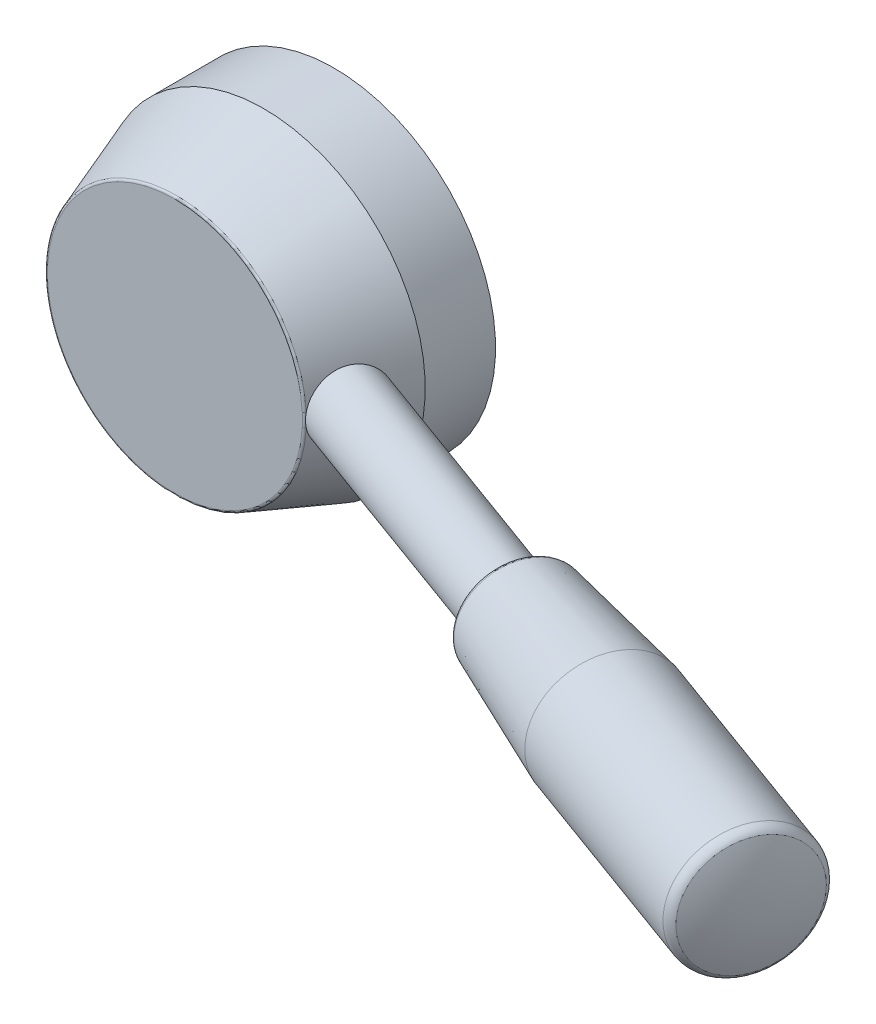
ISO-10303-21;
HEADER;
FILE_DESCRIPTION(('STEP AP214'),'2;1');
FILE_NAME('part.step','',(''),(''),'','','');
FILE_SCHEMA(('AUTOMOTIVE_DESIGN { 1 0 10303 214 1 1 1 1 }'));
ENDSEC;
DATA;
#1=APPLICATION_CONTEXT('core data for automotive mechanical design processes');
#2=APPLICATION_PROTOCOL_DEFINITION('international standard','automotive_design',2000,#1);
#3=PRODUCT_CONTEXT('',#1,'mechanical');
#4=PRODUCT('Part','Part','',(#3));
#5=PRODUCT_RELATED_PRODUCT_CATEGORY('part','',(#4));
#6=PRODUCT_DEFINITION_FORMATION('','',#4);
#7=PRODUCT_DEFINITION_CONTEXT('part definition',#1,'design');
#8=PRODUCT_DEFINITION('design','',#6,#7);
#9=PRODUCT_DEFINITION_SHAPE('','',#8);
#10=(LENGTH_UNIT() NAMED_UNIT(*) SI_UNIT(.MILLI.,.METRE.));
#11=(NAMED_UNIT(*) PLANE_ANGLE_UNIT() SI_UNIT($,.RADIAN.));
#12=(NAMED_UNIT(*) SI_UNIT($,.STERADIAN.) SOLID_ANGLE_UNIT());
#13=UNCERTAINTY_MEASURE_WITH_UNIT(LENGTH_MEASURE(1.E-05),#10,'distance_accuracy_value','');
#14=(GEOMETRIC_REPRESENTATION_CONTEXT(3) GLOBAL_UNCERTAINTY_ASSIGNED_CONTEXT((#13)) GLOBAL_UNIT_ASSIGNED_CONTEXT((#10,
#11,#12)) REPRESENTATION_CONTEXT('',''));
#15=CARTESIAN_POINT('',(0.,0.,0.));
#16=DIRECTION('',(0.,0.,1.));
#17=DIRECTION('',(1.,0.,0.));
#18=AXIS2_PLACEMENT_3D('',#15,#16,#17);
#19=CARTESIAN_POINT('',(-7.,0.,22.));
#20=DIRECTION('',(0.,0.,-1.));
#21=DIRECTION('',(1.,0.,0.));
#22=AXIS2_PLACEMENT_3D('',#19,#20,#21);
#23=PLANE('',#22);
#24=CARTESIAN_POINT('',(0.,0.,22.));
#25=DIRECTION('',(0.,0.,1.));
#26=DIRECTION('',(-1.,0.,0.));
#27=AXIS2_PLACEMENT_3D('',#24,#25,#26);
#28=CIRCLE('',#27,7.);
#29=CARTESIAN_POINT('',(-7.00000000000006,0.,22.));
#30=VERTEX_POINT('',#29);
#31=EDGE_CURVE('E94',#30,#30,#28,.T.);
#32=ORIENTED_EDGE('',*,*,#31,.F.);
#33=EDGE_LOOP('',(#32));
#34=FACE_BOUND('',#33,.T.);
#35=ADVANCED_FACE('F14',(#34),#23,.T.);
#36=CARTESIAN_POINT('',(-1.66533453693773E-13,0.,42.));
#37=DIRECTION('',(0.,0.,1.));
#38=DIRECTION('',(-1.,0.,0.));
#39=AXIS2_PLACEMENT_3D('',#36,#37,#38);
#40=CYLINDRICAL_SURFACE('',#39,7.);
#41=CARTESIAN_POINT('',(0.,0.,0.));
#42=DIRECTION('',(0.,0.,1.));
#43=DIRECTION('',(-1.,0.,0.));
#44=AXIS2_PLACEMENT_3D('',#41,#42,#43);
#45=CIRCLE('',#44,7.);
#46=CARTESIAN_POINT('',(-7.,0.,0.));
#47=VERTEX_POINT('',#46);
#48=EDGE_CURVE('E91',#47,#47,#45,.T.);
#49=ORIENTED_EDGE('',*,*,#48,.F.);
#50=EDGE_LOOP('',(#49));
#51=FACE_BOUND('',#50,.T.);
#52=ORIENTED_EDGE('',*,*,#31,.T.);
#53=EDGE_LOOP('',(#52));
#54=FACE_BOUND('',#53,.T.);
#55=ADVANCED_FACE('F163',(#51,#54),#40,.F.);
#56=CARTESIAN_POINT('',(-32.5,0.,0.));
#57=DIRECTION('',(0.,0.,-1.));
#58=DIRECTION('',(1.,0.,0.));
#59=AXIS2_PLACEMENT_3D('',#56,#57,#58);
#60=PLANE('',#59);
#61=ORIENTED_EDGE('',*,*,#48,.T.);
#62=EDGE_LOOP('',(#61));
#63=FACE_BOUND('',#62,.T.);
#64=CARTESIAN_POINT('',(0.,0.,0.));
#65=DIRECTION('',(0.,0.,1.));
#66=DIRECTION('',(-1.,0.,0.));
#67=AXIS2_PLACEMENT_3D('',#64,#65,#66);
#68=CIRCLE('',#67,32.5);
#69=CARTESIAN_POINT('',(-32.5,0.,0.));
#70=VERTEX_POINT('',#69);
#71=EDGE_CURVE('E87',#70,#70,#68,.T.);
#72=ORIENTED_EDGE('',*,*,#71,.F.);
#73=EDGE_LOOP('',(#72));
#74=FACE_BOUND('',#73,.T.);
#75=ADVANCED_FACE('F168',(#63,#74),#60,.T.);
#76=CARTESIAN_POINT('',(-1.66533453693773E-13,0.,42.));
#77=DIRECTION('',(0.,0.,1.));
#78=DIRECTION('',(-1.,0.,0.));
#79=AXIS2_PLACEMENT_3D('',#76,#77,#78);
#80=CYLINDRICAL_SURFACE('',#79,32.5);
#81=ORIENTED_EDGE('',*,*,#71,.T.);
#82=EDGE_LOOP('',(#81));
#83=FACE_BOUND('',#82,.T.);
#84=CARTESIAN_POINT('',(0.,0.,14.1413967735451));
#85=DIRECTION('',(0.,0.,1.));
#86=DIRECTION('',(-1.,0.,0.));
#87=AXIS2_PLACEMENT_3D('',#84,#85,#86);
#88=CIRCLE('',#87,32.5);
#89=CARTESIAN_POINT('',(-32.5000000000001,0.,14.1413967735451));
#90=VERTEX_POINT('',#89);
#91=EDGE_CURVE('E84',#90,#90,#88,.T.);
#92=ORIENTED_EDGE('',*,*,#91,.F.);
#93=EDGE_LOOP('',(#92));
#94=FACE_BOUND('',#93,.T.);
#95=ADVANCED_FACE('F174',(#83,#94),#80,.T.);
#96=CARTESIAN_POINT('',(-1.11022302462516E-13,0.,31.3420201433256));
#97=DIRECTION('',(0.,0.,-1.));
#98=DIRECTION('',(1.,0.,0.));
#99=AXIS2_PLACEMENT_3D('',#96,#97,#98);
#100=CONICAL_SURFACE('',#99,26.2394850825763,0.349065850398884);
#101=CARTESIAN_POINT('',(30.1740441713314,4.06164475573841,19.7842198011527));
#102=CARTESIAN_POINT('',(30.2316631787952,3.90350658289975,19.685293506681));
#103=CARTESIAN_POINT('',(30.2863833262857,3.74066499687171,19.592313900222));
#104=CARTESIAN_POINT('',(30.3893747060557,3.4065186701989,19.418685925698));
#105=CARTESIAN_POINT('',(30.4376451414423,3.23521288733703,19.3380390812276));
#106=CARTESIAN_POINT('',(30.5270807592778,2.88529911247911,19.1895814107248));
#107=CARTESIAN_POINT('',(30.5682444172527,2.70668956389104,19.121773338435));
#108=CARTESIAN_POINT('',(30.6429092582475,2.34335499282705,18.999407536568));
#109=CARTESIAN_POINT('',(30.6764077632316,2.15862785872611,18.9448544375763));
#110=CARTESIAN_POINT('',(30.7352678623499,1.78433613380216,18.8493616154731));
#111=CARTESIAN_POINT('',(30.7606261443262,1.59476960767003,18.8084274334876));
#112=CARTESIAN_POINT('',(30.8028274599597,1.21222283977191,18.7404728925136));
#113=CARTESIAN_POINT('',(30.8196704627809,1.01924258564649,18.713452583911));
#114=CARTESIAN_POINT('',(30.844596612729,0.631298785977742,18.6735118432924));
#115=CARTESIAN_POINT('',(30.852681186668,0.436335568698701,18.6605891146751));
#116=CARTESIAN_POINT('',(30.8599780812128,0.0458162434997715,18.6489240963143));
#117=CARTESIAN_POINT('',(30.8591902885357,-0.149739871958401,18.6501819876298));
#118=CARTESIAN_POINT('',(30.8488188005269,-0.537581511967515,18.6667659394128));
#119=CARTESIAN_POINT('',(30.8393445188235,-0.729877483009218,18.681917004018));
#120=CARTESIAN_POINT('',(30.8118834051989,-1.11234381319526,18.7259474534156));
#121=CARTESIAN_POINT('',(30.7938936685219,-1.30251342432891,18.7548315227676));
#122=CARTESIAN_POINT('',(30.7496563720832,-1.67928617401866,18.8261340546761));
#123=CARTESIAN_POINT('',(30.7234102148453,-1.86588991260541,18.8685502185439));
#124=CARTESIAN_POINT('',(30.6630207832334,-2.23427512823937,18.9666476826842));
#125=CARTESIAN_POINT('',(30.6288772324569,-2.416056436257,19.0223294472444));
#126=CARTESIAN_POINT('',(30.5530574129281,-2.77402088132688,19.1467732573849));
#127=CARTESIAN_POINT('',(30.5113616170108,-2.95018808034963,19.2155692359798));
#128=CARTESIAN_POINT('',(30.4210547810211,-3.29524035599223,19.3657286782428));
#129=CARTESIAN_POINT('',(30.3724437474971,-3.46412543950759,19.4470921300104));
#130=CARTESIAN_POINT('',(30.2689357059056,-3.79351938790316,19.6219191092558));
#131=CARTESIAN_POINT('',(30.2140380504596,-3.95402738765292,19.7153838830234));
#132=CARTESIAN_POINT('',(30.0986619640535,-4.26560683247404,19.9138759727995));
#133=CARTESIAN_POINT('',(30.0381835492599,-4.41667830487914,20.0189032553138));
#134=CARTESIAN_POINT('',(29.9111657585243,-4.71127815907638,20.2421111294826));
#135=CARTESIAN_POINT('',(29.8445308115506,-4.85460062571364,20.3605092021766));
#136=CARTESIAN_POINT('',(29.707113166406,-5.12942395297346,20.6080164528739));
#137=CARTESIAN_POINT('',(29.6363319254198,-5.26092892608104,20.7371218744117));
#138=CARTESIAN_POINT('',(29.4914482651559,-5.51134773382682,21.0054233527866));
#139=CARTESIAN_POINT('',(29.4173443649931,-5.63025587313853,21.1446239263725));
#140=CARTESIAN_POINT('',(29.2667805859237,-5.85455587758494,21.4322329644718));
#141=CARTESIAN_POINT('',(29.1903215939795,-5.95995275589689,21.5806379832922));
#142=CARTESIAN_POINT('',(29.0351631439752,-6.15753016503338,21.8874000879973));
#143=CARTESIAN_POINT('',(28.9564488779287,-6.24956692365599,22.045842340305));
#144=CARTESIAN_POINT('',(28.7985091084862,-6.41842604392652,22.3703051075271));
#145=CARTESIAN_POINT('',(28.7192838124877,-6.49525422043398,22.5363226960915));
#146=CARTESIAN_POINT('',(28.5612052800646,-6.63316297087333,22.8750162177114));
#147=CARTESIAN_POINT('',(28.4823521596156,-6.69423891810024,23.0476940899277));
#148=CARTESIAN_POINT('',(28.3259806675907,-6.80009445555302,23.3984752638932));
#149=CARTESIAN_POINT('',(28.248461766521,-6.84488065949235,23.5765763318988));
#150=CARTESIAN_POINT('',(28.0967981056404,-6.91723061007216,23.9342007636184));
#151=CARTESIAN_POINT('',(28.0226193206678,-6.94505641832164,24.113656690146));
#152=CARTESIAN_POINT('',(27.8771319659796,-6.98434104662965,24.4754222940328));
#153=CARTESIAN_POINT('',(27.8058223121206,-6.99580610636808,24.6577308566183));
#154=CARTESIAN_POINT('',(27.6667052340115,-7.0022817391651,25.0239816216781));
#155=CARTESIAN_POINT('',(27.5988980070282,-6.99729138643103,25.2079239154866));
#156=CARTESIAN_POINT('',(27.4673529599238,-6.9708870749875,25.5760832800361));
#157=CARTESIAN_POINT('',(27.4036150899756,-6.94947331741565,25.7603003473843));
#158=CARTESIAN_POINT('',(27.2819200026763,-6.89100662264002,26.1238470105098));
#159=CARTESIAN_POINT('',(27.2238708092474,-6.85428463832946,26.3031991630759));
#160=CARTESIAN_POINT('',(27.1123837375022,-6.7655313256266,26.6596039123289));
#161=CARTESIAN_POINT('',(27.0589474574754,-6.71349471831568,26.8366556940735));
#162=CARTESIAN_POINT('',(26.9569088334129,-6.59454400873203,27.1870447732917));
#163=CARTESIAN_POINT('',(26.9083049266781,-6.52763473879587,27.3603832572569));
#164=CARTESIAN_POINT('',(26.8159619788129,-6.37941115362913,27.7022049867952));
#165=CARTESIAN_POINT('',(26.7722247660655,-6.29809145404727,27.870686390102));
#166=CARTESIAN_POINT('',(26.6892967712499,-6.12101792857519,28.2027076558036));
#167=CARTESIAN_POINT('',(26.6501414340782,-6.02516325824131,28.3662025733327));
#168=CARTESIAN_POINT('',(26.5766020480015,-5.82011166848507,28.6858069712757));
#169=CARTESIAN_POINT('',(26.5422196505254,-5.7109101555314,28.8419138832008));
#170=CARTESIAN_POINT('',(26.4780278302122,-5.47994279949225,29.1455283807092));
#171=CARTESIAN_POINT('',(26.4482182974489,-5.35817725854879,29.2930361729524));
#172=CARTESIAN_POINT('',(26.3928938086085,-5.10288362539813,29.5783610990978));
#173=CARTESIAN_POINT('',(26.3673789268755,-4.96935532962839,29.7161780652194));
#174=CARTESIAN_POINT('',(26.3197163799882,-4.68781014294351,29.9844911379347));
#175=CARTESIAN_POINT('',(26.2976723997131,-4.53950860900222,30.1147071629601));
#176=CARTESIAN_POINT('',(26.2573974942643,-4.23246917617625,30.3627317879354));
#177=CARTESIAN_POINT('',(26.239165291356,-4.0737347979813,30.4805445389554));
#178=CARTESIAN_POINT('',(26.2061128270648,-3.7467699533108,30.7028541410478));
#179=CARTESIAN_POINT('',(26.1912939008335,-3.57853580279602,30.8073457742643));
#180=CARTESIAN_POINT('',(26.164704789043,-3.2338208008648,31.0019886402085));
#181=CARTESIAN_POINT('',(26.15293341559,-3.05734319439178,31.0921454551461));
#182=CARTESIAN_POINT('',(26.1320573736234,-2.6969079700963,31.2574963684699));
#183=CARTESIAN_POINT('',(26.1229583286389,-2.51293549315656,31.3326588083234));
#184=CARTESIAN_POINT('',(26.107148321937,-2.13922514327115,31.4670165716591));
#185=CARTESIAN_POINT('',(26.1004364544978,-1.9494894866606,31.5262179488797));
#186=CARTESIAN_POINT('',(26.0891355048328,-1.56556096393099,31.6280806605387));
#187=CARTESIAN_POINT('',(26.084546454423,-1.37136803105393,31.6707417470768));
#188=CARTESIAN_POINT('',(26.0772965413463,-0.979979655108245,31.7390642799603));
#189=CARTESIAN_POINT('',(26.0746356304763,-0.782784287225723,31.7647261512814));
#190=CARTESIAN_POINT('',(26.0711694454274,-0.392244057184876,31.7983098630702));
#191=CARTESIAN_POINT('',(26.0703159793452,-0.198939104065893,31.8066922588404));
#192=CARTESIAN_POINT('',(26.0702833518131,0.187753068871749,31.80701095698));
#193=CARTESIAN_POINT('',(26.0711047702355,0.38114029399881,31.7989415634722));
#194=CARTESIAN_POINT('',(26.0744585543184,0.76643589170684,31.7664370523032));
#195=CARTESIAN_POINT('',(26.0769902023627,0.958344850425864,31.7420087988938));
#196=CARTESIAN_POINT('',(26.083873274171,1.33945369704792,31.6770358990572));
#197=CARTESIAN_POINT('',(26.0882253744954,1.52865255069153,31.6364852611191));
#198=CARTESIAN_POINT('',(26.0988647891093,1.90081800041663,31.5402264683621));
#199=CARTESIAN_POINT('',(26.1051297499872,2.08383079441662,31.4846942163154));
#200=CARTESIAN_POINT('',(26.1198402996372,2.44465918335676,31.3587887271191));
#201=CARTESIAN_POINT('',(26.1282866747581,2.62247287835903,31.2884101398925));
#202=CARTESIAN_POINT('',(26.147631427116,2.97162622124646,31.1334904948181));
#203=CARTESIAN_POINT('',(26.1585292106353,3.14296742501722,31.0489528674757));
#204=CARTESIAN_POINT('',(26.183093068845,3.47818848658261,30.8664135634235));
#205=CARTESIAN_POINT('',(26.1967601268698,3.64206566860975,30.7684071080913));
#206=CARTESIAN_POINT('',(26.2275426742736,3.96491630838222,30.5573908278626));
#207=CARTESIAN_POINT('',(26.2447297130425,4.12369264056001,30.4440897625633));
#208=CARTESIAN_POINT('',(26.2827173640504,4.43128131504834,30.2052299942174));
#209=CARTESIAN_POINT('',(26.3035180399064,4.58009348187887,30.0796710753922));
#210=CARTESIAN_POINT('',(26.349103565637,4.86683555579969,29.8172670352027));
#211=CARTESIAN_POINT('',(26.3738895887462,5.00476224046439,29.6804185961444));
#212=CARTESIAN_POINT('',(26.4277731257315,5.26873668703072,29.396584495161));
#213=CARTESIAN_POINT('',(26.4568691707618,5.39478847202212,29.2496022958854));
#214=CARTESIAN_POINT('',(26.5203068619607,5.63661555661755,28.9435491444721));
#215=CARTESIAN_POINT('',(26.554741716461,5.7521351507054,28.7842953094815));
#216=CARTESIAN_POINT('',(26.6286537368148,5.96911320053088,28.4576766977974));
#217=CARTESIAN_POINT('',(26.6681290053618,6.07057691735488,28.2903149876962));
#218=CARTESIAN_POINT('',(26.7523099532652,6.25875678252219,27.9486841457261));
#219=CARTESIAN_POINT('',(26.7970171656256,6.34546859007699,27.7744129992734));
#220=CARTESIAN_POINT('',(26.8916931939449,6.50339159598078,27.4204493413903));
#221=CARTESIAN_POINT('',(26.9416598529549,6.57460911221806,27.2407590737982));
#222=CARTESIAN_POINT('',(27.0460434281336,6.70008726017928,26.879943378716));
#223=CARTESIAN_POINT('',(27.1003853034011,6.75457881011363,26.6988765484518));
#224=CARTESIAN_POINT('',(27.2139239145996,6.84752005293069,26.3342433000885));
#225=CARTESIAN_POINT('',(27.2731187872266,6.88597586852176,26.1506778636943));
#226=CARTESIAN_POINT('',(27.3960672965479,6.94655680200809,25.7823720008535));
#227=CARTESIAN_POINT('',(27.459821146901,6.96868115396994,25.5976315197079));
#228=CARTESIAN_POINT('',(27.5914404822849,6.99641387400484,25.2283772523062));
#229=CARTESIAN_POINT('',(27.6593059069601,7.00202248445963,25.043863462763));
#230=CARTESIAN_POINT('',(27.7969804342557,6.99674792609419,24.6806557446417));
#231=CARTESIAN_POINT('',(27.8667088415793,6.98624138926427,24.5019256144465));
#232=CARTESIAN_POINT('',(28.0089554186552,6.94951780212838,24.1471386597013));
#233=CARTESIAN_POINT('',(28.0814745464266,6.92329531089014,23.9710827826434));
#234=CARTESIAN_POINT('',(28.2285610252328,6.85536144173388,23.6229085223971));
#235=CARTESIAN_POINT('',(28.3031279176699,6.81365350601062,23.4507892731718));
#236=CARTESIAN_POINT('',(28.4535896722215,6.71506208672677,23.1114723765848));
#237=CARTESIAN_POINT('',(28.5294850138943,6.65817301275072,22.9442765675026));
#238=CARTESIAN_POINT('',(28.6822206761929,6.52927740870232,22.6149083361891));
#239=CARTESIAN_POINT('',(28.7590639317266,6.45718322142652,22.4527715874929));
#240=CARTESIAN_POINT('',(28.9123989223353,6.298614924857,22.1355145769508));
#241=CARTESIAN_POINT('',(28.9888906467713,6.21214038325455,21.9803945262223));
#242=CARTESIAN_POINT('',(29.1406287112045,6.02545366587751,21.6781033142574));
#243=CARTESIAN_POINT('',(29.2158755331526,5.92524695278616,21.5309290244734));
#244=CARTESIAN_POINT('',(29.3642704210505,5.71178870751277,21.2453030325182));
#245=CARTESIAN_POINT('',(29.4374186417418,5.5985381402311,21.1068506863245));
#246=CARTESIAN_POINT('',(29.6310985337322,5.27586039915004,20.7455000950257));
#247=CARTESIAN_POINT('',(29.7488883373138,5.05467911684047,20.5314658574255));
#248=CARTESIAN_POINT('',(29.9718710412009,4.58065528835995,20.1340785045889));
#249=CARTESIAN_POINT('',(30.0770637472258,4.32781225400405,19.9507258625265));
#250=CARTESIAN_POINT('',(30.1740441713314,4.06164475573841,19.7842198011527));
#251=B_SPLINE_CURVE_WITH_KNOTS('',3,(#101,#102,#103,#104,#105,#106,#107,#108,#109,#110,#111,
#112,#113,#114,#115,#116,#117,#118,#119,#120,#121,#122,#123,#124,#125,#126,#127,#128,#129,#130,
#131,#132,#133,#134,#135,#136,#137,#138,#139,#140,#141,#142,#143,#144,#145,#146,#147,#148,#149,
#150,#151,#152,#153,#154,#155,#156,#157,#158,#159,#160,#161,#162,#163,#164,#165,#166,#167,#168,
#169,#170,#171,#172,#173,#174,#175,#176,#177,#178,#179,#180,#181,#182,#183,#184,#185,#186,#187,
#188,#189,#190,#191,#192,#193,#194,#195,#196,#197,#198,#199,#200,#201,#202,#203,#204,#205,#206,
#207,#208,#209,#210,#211,#212,#213,#214,#215,#216,#217,#218,#219,#220,#221,#222,#223,#224,#225,
#226,#227,#228,#229,#230,#231,#232,#233,#234,#235,#236,#237,#238,#239,#240,#241,#242,#243,#244,
#245,#246,#247,#248,#249,#250),.UNSPECIFIED.,.T.,.F.,(4,2,2,2,2,2,2,2,2,2,2,2,2,2,2,2,2,2,2,2,2,
2,2,2,2,2,2,2,2,2,2,2,2,2,2,2,2,2,2,2,2,2,2,2,2,2,2,2,2,2,2,2,2,2,2,2,2,2,2,2,2,2,2,2,2,2,2,2,2,
2,2,2,2,2,4),(0.,0.585412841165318,1.17089794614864,1.75650848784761,2.34232331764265,
2.9283762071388,3.51443121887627,4.10039074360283,4.68635774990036,5.26504392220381,
5.84392763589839,6.42271306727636,7.00151875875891,7.58184295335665,8.16216659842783,
8.74255005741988,9.32293183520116,9.91469060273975,10.5062426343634,11.0980609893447,
11.6896591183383,12.2872144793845,12.8845409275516,13.4820426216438,14.0793014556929,
14.6670810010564,15.2546363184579,15.8422246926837,16.4298058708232,17.0052935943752,
17.580979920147,18.1564794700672,18.7321945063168,19.3121039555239,19.8922135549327,
20.4723092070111,21.0524149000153,21.6474658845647,22.2423170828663,22.8374005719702,
23.4322517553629,24.0283458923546,24.6242136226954,25.2200902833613,25.8159520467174,
26.3957152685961,26.97567924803,27.55540002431,28.1353364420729,28.7087396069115,
29.2823497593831,29.8558211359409,30.4294965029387,31.0162577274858,31.6030292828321,
32.1899738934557,32.7767189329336,33.3751894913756,33.9734354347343,34.5718571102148,
35.1700343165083,35.7595372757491,36.3488149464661,36.9381202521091,37.5274169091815,
38.1031492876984,38.6790811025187,39.254884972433,39.8309011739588,40.410333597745,
40.9897834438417,41.5690034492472,42.1481806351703,43.1334928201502,44.118820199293),.UNSPECIFIED.);
#252=CARTESIAN_POINT('',(26.0845396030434,1.35563421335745,31.6710100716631));
#253=VERTEX_POINT('',#252);
#254=CARTESIAN_POINT('',(26.0845396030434,-1.35563421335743,31.6710100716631));
#255=VERTEX_POINT('',#254);
#256=EDGE_CURVE('E83',#253,#255,#251,.T.);
#257=ORIENTED_EDGE('',*,*,#256,.T.);
#258=CARTESIAN_POINT('',(-1.11022302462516E-13,0.,31.6710100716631));
#259=DIRECTION('',(0.,0.,1.));
#260=DIRECTION('',(-1.,0.,0.));
#261=AXIS2_PLACEMENT_3D('',#258,#259,#260);
#262=CIRCLE('',#261,26.1197425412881);
#263=EDGE_CURVE('E9',#255,#253,#262,.F.);
#264=ORIENTED_EDGE('',*,*,#263,.T.);
#265=EDGE_LOOP('',(#257,#264));
#266=FACE_BOUND('',#265,.T.);
#267=ORIENTED_EDGE('',*,*,#91,.T.);
#268=EDGE_LOOP('',(#267));
#269=FACE_BOUND('',#268,.T.);
#270=ADVANCED_FACE('F104',(#266,#269),#100,.T.);
#271=CARTESIAN_POINT('',(-25.2997924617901,0.,32.));
#272=DIRECTION('',(0.,0.,-1.));
#273=DIRECTION('',(1.,0.,0.));
#274=AXIS2_PLACEMENT_3D('',#271,#272,#273);
#275=PLANE('',#274);
#276=CARTESIAN_POINT('',(-1.11022302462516E-13,0.,32.));
#277=DIRECTION('',(0.,0.,-1.));
#278=DIRECTION('',(1.,0.,0.));
#279=AXIS2_PLACEMENT_3D('',#276,#277,#278);
#280=CIRCLE('',#279,25.6498962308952);
#281=CARTESIAN_POINT('',(25.6153265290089,1.33124883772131,32.));
#282=VERTEX_POINT('',#281);
#283=CARTESIAN_POINT('',(25.6153265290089,-1.33124883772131,32.));
#284=VERTEX_POINT('',#283);
#285=EDGE_CURVE('E97',#282,#284,#280,.F.);
#286=ORIENTED_EDGE('',*,*,#285,.T.);
#287=CARTESIAN_POINT('',(26.158038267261,-3.12754009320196,31.0539220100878));
#288=CARTESIAN_POINT('',(26.1347109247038,-2.77619489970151,31.2322111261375));
#289=CARTESIAN_POINT('',(26.1407825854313,-2.86764332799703,31.6161055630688));
#290=CARTESIAN_POINT('',(26.1468542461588,-2.95909175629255,32.));
#291=CARTESIAN_POINT('',(26.1730014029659,-3.35290763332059,32.0000000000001));
#292=CARTESIAN_POINT('',(26.1580383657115,-3.12754142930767,31.0539212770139));
#293=CARTESIAN_POINT('',(26.1454197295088,-2.7754701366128,31.2322081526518));
#294=CARTESIAN_POINT('',(26.1487050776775,-2.86710356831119,31.6161039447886));
#295=CARTESIAN_POINT('',(26.1519899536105,-2.95873786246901,32.));
#296=CARTESIAN_POINT('',(26.1661343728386,-3.35336516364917,32.0000000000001));
#297=CARTESIAN_POINT('',(26.1580227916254,-3.1273068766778,31.0540403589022));
#298=CARTESIAN_POINT('',(26.1561439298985,-2.77521854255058,31.2324658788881));
#299=CARTESIAN_POINT('',(26.1566427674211,-2.86698502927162,31.6162329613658));
#300=CARTESIAN_POINT('',(26.1571383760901,-2.95875162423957,32.0000000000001));
#301=CARTESIAN_POINT('',(26.1592498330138,-3.35350504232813,32.0000000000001));
#302=CARTESIAN_POINT('',(26.1579612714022,-3.12637944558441,31.0545108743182));
#303=CARTESIAN_POINT('',(26.1772628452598,-2.77556974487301,31.233476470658));
#304=CARTESIAN_POINT('',(26.172213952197,-2.86749872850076,31.6167383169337));
#305=CARTESIAN_POINT('',(26.1671619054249,-2.95942739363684,32.0000000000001));
#306=CARTESIAN_POINT('',(26.1455033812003,-3.35316358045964,32.0000000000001));
#307=CARTESIAN_POINT('',(26.1579153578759,-3.12568705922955,31.0548620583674));
#308=CARTESIAN_POINT('',(26.1876538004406,-2.77617120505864,31.2342283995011));
#309=CARTESIAN_POINT('',(26.1798477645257,-2.86813016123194,31.6171143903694));
#310=CARTESIAN_POINT('',(26.1720354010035,-2.96008830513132,32.0000000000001));
#311=CARTESIAN_POINT('',(26.1386414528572,-3.35268290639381,32.0000000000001));
#312=CARTESIAN_POINT('',(26.1577348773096,-3.12296310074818,31.0562428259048));
#313=CARTESIAN_POINT('',(26.2175816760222,-2.7790907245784,31.2371617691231));
#314=CARTESIAN_POINT('',(26.2016537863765,-2.87099035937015,31.6185816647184));
#315=CARTESIAN_POINT('',(26.1857040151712,-2.9628870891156,32.));
#316=CARTESIAN_POINT('',(26.1183073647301,-3.35034920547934,32.0000000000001));
#317=CARTESIAN_POINT('',(26.1575575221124,-3.12028405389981,31.0575999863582));
#318=CARTESIAN_POINT('',(26.2361347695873,-2.78250823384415,31.2400197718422));
#319=CARTESIAN_POINT('',(26.2149231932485,-2.87417717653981,31.6200125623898));
#320=CARTESIAN_POINT('',(26.1936792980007,-2.9658343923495,32.));
#321=CARTESIAN_POINT('',(26.104930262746,-3.34761399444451,32.0000000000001));
#322=CARTESIAN_POINT('',(26.1570538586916,-3.112649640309,31.06145765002));
#323=CARTESIAN_POINT('',(26.2726638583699,-2.79167438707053,31.2479338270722));
#324=CARTESIAN_POINT('',(26.2401387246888,-2.88246122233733,31.6239705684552));
#325=CARTESIAN_POINT('',(26.2075648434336,-2.97323339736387,32.));
#326=CARTESIAN_POINT('',(26.0758410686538,-3.33922603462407,32.0000000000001));
#327=CARTESIAN_POINT('',(26.1567029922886,-3.10731738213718,31.0641468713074));
#328=CARTESIAN_POINT('',(26.2895728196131,-2.79776398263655,31.2533298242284));
#329=CARTESIAN_POINT('',(26.251112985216,-2.88782711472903,31.626672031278));
#330=CARTESIAN_POINT('',(26.2126157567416,-2.97786755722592,32.));
#331=CARTESIAN_POINT('',(26.0602820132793,-3.33305476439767,32.0000000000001));
#332=CARTESIAN_POINT('',(26.1558889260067,-3.09487321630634,31.0703958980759));
#333=CARTESIAN_POINT('',(26.3170259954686,-2.80940541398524,31.2653759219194));
#334=CARTESIAN_POINT('',(26.2674214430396,-2.89768258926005,31.6326952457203));
#335=CARTESIAN_POINT('',(26.2177762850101,-2.98593531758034,32.0000000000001));
#336=CARTESIAN_POINT('',(26.0303337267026,-3.31825760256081,32.0000000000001));
#337=CARTESIAN_POINT('',(26.1554252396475,-3.08775359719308,31.0739594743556));
#338=CARTESIAN_POINT('',(26.3275602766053,-2.81495217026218,31.2720200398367));
#339=CARTESIAN_POINT('',(26.2727306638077,-2.90216822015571,31.6360196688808));
#340=CARTESIAN_POINT('',(26.2178855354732,-2.98936573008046,32.));
#341=CARTESIAN_POINT('',(26.0159499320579,-3.30962105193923,32.0000000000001));
#342=CARTESIAN_POINT('',(26.1541463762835,-3.06797987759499,31.0838059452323));
#343=CARTESIAN_POINT('',(26.347981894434,-2.82658288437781,31.2896356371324));
#344=CARTESIAN_POINT('',(26.2808408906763,-2.91087678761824,31.6448397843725));
#345=CARTESIAN_POINT('',(26.2136560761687,-2.99512652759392,32.));
#346=CARTESIAN_POINT('',(25.9809900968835,-3.28536346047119,32.0000000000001));
#347=CARTESIAN_POINT('',(26.1532769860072,-3.05441873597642,31.0905152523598));
#348=CARTESIAN_POINT('',(26.3545360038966,-2.83137821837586,31.3010210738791));
#349=CARTESIAN_POINT('',(26.2807184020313,-2.91363690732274,31.6505349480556));
#350=CARTESIAN_POINT('',(26.2069228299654,-2.99589889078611,32.));
#351=CARTESIAN_POINT('',(25.9612882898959,-3.2684951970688,32.0000000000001));
#352=CARTESIAN_POINT('',(26.1514315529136,-3.02526118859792,31.1048043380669));
#353=CARTESIAN_POINT('',(26.3609406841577,-2.83547096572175,31.3238906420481));
#354=CARTESIAN_POINT('',(26.2752494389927,-2.91355014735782,31.6619707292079));
#355=CARTESIAN_POINT('',(26.1895838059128,-2.99162680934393,32.0000000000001));
#356=CARTESIAN_POINT('',(25.9246344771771,-3.23202664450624,32.0000000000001));
#357=CARTESIAN_POINT('',(26.1504552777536,-3.0096603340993,31.1123860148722));
#358=CARTESIAN_POINT('',(26.360834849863,-2.83480407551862,31.3353752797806));
#359=CARTESIAN_POINT('',(26.2698913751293,-2.91069081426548,31.6677114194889));
#360=CARTESIAN_POINT('',(26.1790021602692,-2.9866197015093,32.));
#361=CARTESIAN_POINT('',(25.9076886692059,-3.21242037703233,32.0000000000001));
#362=CARTESIAN_POINT('',(26.1485023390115,-2.97801641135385,31.1276062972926));
#363=CARTESIAN_POINT('',(26.3571655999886,-2.82911695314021,31.357329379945));
#364=CARTESIAN_POINT('',(26.2571153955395,-2.90077517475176,31.6786856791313));
#365=CARTESIAN_POINT('',(26.1571150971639,-2.97247209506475,32.));
#366=CARTESIAN_POINT('',(25.8770098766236,-3.17262150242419,32.0000000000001));
#367=CARTESIAN_POINT('',(26.1475288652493,-2.96204915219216,31.1352170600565));
#368=CARTESIAN_POINT('',(26.3538253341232,-2.82437969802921,31.3678208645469));
#369=CARTESIAN_POINT('',(26.2498321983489,-2.89396721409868,31.6839295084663));
#370=CARTESIAN_POINT('',(26.1458962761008,-2.96361679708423,32.));
#371=CARTESIAN_POINT('',(25.8631488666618,-3.15252591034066,32.0000000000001));
#372=CARTESIAN_POINT('',(26.1455528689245,-2.92918854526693,31.1507195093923));
#373=CARTESIAN_POINT('',(26.3454251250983,-2.81167109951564,31.3883258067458));
#374=CARTESIAN_POINT('',(26.2343287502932,-2.87718812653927,31.6941819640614));
#375=CARTESIAN_POINT('',(26.1232904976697,-2.94276791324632,32.0000000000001));
#376=CARTESIAN_POINT('',(25.8371843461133,-3.11122032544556,32.0000000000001));
#377=CARTESIAN_POINT('',(26.1445503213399,-2.91229438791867,31.1586114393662));
#378=CARTESIAN_POINT('',(26.3403745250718,-2.80371800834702,31.3983468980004));
#379=CARTESIAN_POINT('',(26.2261076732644,-2.86721419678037,31.6991903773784));
#380=CARTESIAN_POINT('',(26.1118996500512,-2.93079016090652,32.0000000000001));
#381=CARTESIAN_POINT('',(25.8250824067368,-3.090009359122,32.0000000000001));
#382=CARTESIAN_POINT('',(26.1415225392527,-2.86052780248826,31.1825319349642));
#383=CARTESIAN_POINT('',(26.323993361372,-2.7761619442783,31.4275481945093));
#384=CARTESIAN_POINT('',(26.201080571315,-2.83364658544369,31.7138415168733));
#385=CARTESIAN_POINT('',(26.0783961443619,-2.89143579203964,32.));
#386=CARTESIAN_POINT('',(25.7910008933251,-3.02517811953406,32.0000000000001));
#387=CARTESIAN_POINT('',(26.1394783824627,-2.82459084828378,31.19879573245));
#388=CARTESIAN_POINT('',(26.3113449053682,-2.75275452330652,31.4461015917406));
#389=CARTESIAN_POINT('',(26.1839204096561,-2.80641492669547,31.723103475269));
#390=CARTESIAN_POINT('',(26.0566908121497,-2.86043722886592,32.));
#391=CARTESIAN_POINT('',(25.7712633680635,-2.98038429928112,32.0000000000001));
#392=CARTESIAN_POINT('',(26.1346673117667,-2.73732139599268,31.2373620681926));
#393=CARTESIAN_POINT('',(26.2811145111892,-2.68994466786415,31.4875946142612));
#394=CARTESIAN_POINT('',(26.1448532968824,-2.73497707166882,31.7438954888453));
#395=CARTESIAN_POINT('',(26.0089651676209,-2.78068427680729,32.));
#396=CARTESIAN_POINT('',(25.7298890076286,-2.87243968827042,32.0000000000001));
#397=CARTESIAN_POINT('',(26.1319096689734,-2.68516772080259,31.2596963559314));
#398=CARTESIAN_POINT('',(26.2632965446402,-2.64771296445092,31.5098870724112));
#399=CARTESIAN_POINT('',(26.123507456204,-2.68820593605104,31.7550151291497));
#400=CARTESIAN_POINT('',(25.9839864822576,-2.72937719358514,32.));
#401=CARTESIAN_POINT('',(25.7102005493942,-2.8085701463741,32.0000000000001));
#402=CARTESIAN_POINT('',(26.1265067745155,-2.5782117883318,31.3039074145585));
#403=CARTESIAN_POINT('',(26.2293028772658,-2.55604064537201,31.5515300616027));
#404=CARTESIAN_POINT('',(26.0842722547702,-2.5882139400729,31.775835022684));
#405=CARTESIAN_POINT('',(25.9395071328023,-2.62106882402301,32.0000000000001));
#406=CARTESIAN_POINT('',(25.6768910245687,-2.67920028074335,32.0000000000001));
#407=CARTESIAN_POINT('',(26.1238617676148,-2.52340426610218,31.3257831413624));
#408=CARTESIAN_POINT('',(26.2130712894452,-2.5065820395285,31.5709596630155));
#409=CARTESIAN_POINT('',(26.0663901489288,-2.53497991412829,31.7855322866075));
#410=CARTESIAN_POINT('',(25.9198953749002,-2.56401408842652,32.0000000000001));
#411=CARTESIAN_POINT('',(25.6632826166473,-2.61369685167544,32.0000000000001));
#412=CARTESIAN_POINT('',(26.1187091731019,-2.41132863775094,31.3688330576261));
#413=CARTESIAN_POINT('',(26.1826887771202,-2.40259320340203,31.6074874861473));
#414=CARTESIAN_POINT('',(26.033908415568,-2.42407198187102,31.8037962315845));
#415=CARTESIAN_POINT('',(25.8853149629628,-2.44618899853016,32.0000000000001));
#416=CARTESIAN_POINT('',(25.6406724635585,-2.48147613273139,32.0000000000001));
#417=CARTESIAN_POINT('',(26.1162026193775,-2.35404656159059,31.3900015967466));
#418=CARTESIAN_POINT('',(26.1685003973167,-2.34799360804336,31.6246299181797));
#419=CARTESIAN_POINT('',(26.019331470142,-2.36637083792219,31.8123549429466));
#420=CARTESIAN_POINT('',(25.8702927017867,-2.38533025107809,32.0000000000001));
#421=CARTESIAN_POINT('',(25.6317020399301,-2.4147536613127,32.0000000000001));
#422=CARTESIAN_POINT('',(26.1113699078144,-2.23772838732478,31.4312200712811));
#423=CARTESIAN_POINT('',(26.1423809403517,-2.23549050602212,31.6567909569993));
#424=CARTESIAN_POINT('',(25.9932796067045,-2.24825440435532,31.828434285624));
#425=CARTESIAN_POINT('',(25.8443034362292,-2.26159363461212,32.));
#426=CARTESIAN_POINT('',(25.6174932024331,-2.28102227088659,32.0000000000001));
#427=CARTESIAN_POINT('',(26.1090435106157,-2.17869476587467,31.4512714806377));
#428=CARTESIAN_POINT('',(26.1304073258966,-2.17754750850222,31.6718547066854));
#429=CARTESIAN_POINT('',(25.9818005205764,-2.1878428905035,31.8359563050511));
#430=CARTESIAN_POINT('',(25.8332741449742,-2.19865451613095,32.));
#431=CARTESIAN_POINT('',(25.6122497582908,-2.21401386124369,32.0000000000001));
#432=CARTESIAN_POINT('',(26.102067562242,-1.99163135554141,31.5119539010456));
#433=CARTESIAN_POINT('',(26.0964333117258,-1.99348675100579,31.7158797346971));
#434=CARTESIAN_POINT('',(25.9500937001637,-1.99600186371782,31.8580747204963));
#435=CARTESIAN_POINT('',(25.8041461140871,-2.00082681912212,32.));
#436=CARTESIAN_POINT('',(25.6004144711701,-2.00437122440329,32.0000000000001));
#437=CARTESIAN_POINT('',(26.0977486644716,-1.86069213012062,31.5503606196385));
#438=CARTESIAN_POINT('',(26.0777599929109,-1.86182108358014,31.7420686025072));
#439=CARTESIAN_POINT('',(25.9345511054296,-1.86113219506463,31.8711102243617));
#440=CARTESIAN_POINT('',(25.7914985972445,-1.86222921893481,32.));
#441=CARTESIAN_POINT('',(25.5989413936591,-1.86146173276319,32.0000000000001));
#442=CARTESIAN_POINT('',(26.0900224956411,-1.59253076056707,31.6201880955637));
#443=CARTESIAN_POINT('',(26.0479851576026,-1.59213228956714,31.7877010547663));
#444=CARTESIAN_POINT('',(25.9119079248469,-1.58653853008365,31.8939220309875));
#445=CARTESIAN_POINT('',(25.7759670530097,-1.58270761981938,32.0000000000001));
#446=CARTESIAN_POINT('',(25.6036108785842,-1.57573453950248,32.0000000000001));
#447=CARTESIAN_POINT('',(26.0866162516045,-1.45530174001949,31.6516009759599));
#448=CARTESIAN_POINT('',(26.0367366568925,-1.45365290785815,31.8073131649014));
#449=CARTESIAN_POINT('',(25.9048168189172,-1.44680926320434,31.9036946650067));
#450=CARTESIAN_POINT('',(25.7729384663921,-1.44126095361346,32.0000000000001));
#451=CARTESIAN_POINT('',(25.6097619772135,-1.43291712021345,32.0000000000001));
#452=CARTESIAN_POINT('',(26.0807417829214,-1.1753823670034,31.7064577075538));
#453=CARTESIAN_POINT('',(26.0196500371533,-1.17228850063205,31.8405997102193));
#454=CARTESIAN_POINT('',(25.8959242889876,-1.16397958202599,31.9203377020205));
#455=CARTESIAN_POINT('',(25.7722382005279,-1.15695600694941,32.));
#456=CARTESIAN_POINT('',(25.6252687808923,-1.14717222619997,32.0000000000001));
#457=CARTESIAN_POINT('',(26.0782755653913,-1.03268103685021,31.7298844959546));
#458=CARTESIAN_POINT('',(26.0137457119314,-1.02896404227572,31.8543710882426));
#459=CARTESIAN_POINT('',(25.8941341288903,-1.02087263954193,31.9272018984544));
#460=CARTESIAN_POINT('',(25.7745280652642,-1.01363254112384,32.0000000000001));
#461=CARTESIAN_POINT('',(25.634631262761,-1.00424516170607,32.0000000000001));
#462=CARTESIAN_POINT('',(26.0743136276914,-0.743364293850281,31.7678161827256));
#463=CARTESIAN_POINT('',(26.0054092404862,-0.739699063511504,31.8762873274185));
#464=CARTESIAN_POINT('',(25.8929491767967,-0.732628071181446,31.9381594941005));
#465=CARTESIAN_POINT('',(25.7804905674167,-0.726398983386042,32.0000000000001));
#466=CARTESIAN_POINT('',(25.6522542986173,-0.718403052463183,32.0000000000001));
#467=CARTESIAN_POINT('',(26.0728173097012,-0.596751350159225,31.7823265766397));
#468=CARTESIAN_POINT('',(26.0029422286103,-0.59334323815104,31.8845012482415));
#469=CARTESIAN_POINT('',(25.8935529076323,-0.587491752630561,31.9422546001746));
#470=CARTESIAN_POINT('',(25.7841631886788,-0.582063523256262,32.));
#471=CARTESIAN_POINT('',(25.6605155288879,-0.575488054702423,32.0000000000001));
#472=CARTESIAN_POINT('',(26.0708155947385,-0.301464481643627,31.8017901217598));
#473=CARTESIAN_POINT('',(25.9998784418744,-0.299562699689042,31.8954361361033));
#474=CARTESIAN_POINT('',(25.8947110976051,-0.296251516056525,31.9477220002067));
#475=CARTESIAN_POINT('',(25.7895408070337,-0.293359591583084,32.0000000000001));
#476=CARTESIAN_POINT('',(25.6721199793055,-0.289699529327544,32.0000000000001));
#477=CARTESIAN_POINT('',(26.070308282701,-0.152795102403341,31.8067617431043));
#478=CARTESIAN_POINT('',(25.999268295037,-0.1517240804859,31.8981991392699));
#479=CARTESIAN_POINT('',(25.8952656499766,-0.150150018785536,31.9490995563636));
#480=CARTESIAN_POINT('',(25.7912629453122,-0.148579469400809,32.0000000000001));
#481=CARTESIAN_POINT('',(25.6754727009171,-0.146826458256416,32.0000000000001));
#482=CARTESIAN_POINT('',(26.0702897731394,0.144586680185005,31.8069408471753));
#483=CARTESIAN_POINT('',(25.9992439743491,0.14357013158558,31.8982988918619));
#484=CARTESIAN_POINT('',(25.8952820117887,0.14208536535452,31.9491494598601));
#485=CARTESIAN_POINT('',(25.7913201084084,0.140596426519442,32.0000000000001));
#486=CARTESIAN_POINT('',(25.675588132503,0.138942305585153,32.0000000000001));
#487=CARTESIAN_POINT('',(26.0707787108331,0.293299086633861,31.8021470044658));
#488=CARTESIAN_POINT('',(25.999829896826,0.29144645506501,31.8956351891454));
#489=CARTESIAN_POINT('',(25.8947436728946,0.288219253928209,31.9478214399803));
#490=CARTESIAN_POINT('',(25.7896548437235,0.285404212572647,32.));
#491=CARTESIAN_POINT('',(25.6723499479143,0.281837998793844,32.0000000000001));
#492=CARTESIAN_POINT('',(26.0727427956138,0.588435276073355,31.783045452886));
#493=CARTESIAN_POINT('',(26.0028214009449,0.585054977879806,31.8849070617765));
#494=CARTESIAN_POINT('',(25.8935849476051,0.579270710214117,31.9424572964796));
#495=CARTESIAN_POINT('',(25.7843478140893,0.573900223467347,32.0000000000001));
#496=CARTESIAN_POINT('',(25.6609284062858,0.567402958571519,32.0000000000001));
#497=CARTESIAN_POINT('',(26.0742179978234,0.73485893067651,31.7687372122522));
#498=CARTESIAN_POINT('',(26.0052365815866,0.731204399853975,31.876811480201));
#499=CARTESIAN_POINT('',(25.8929645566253,0.724188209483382,31.938421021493));
#500=CARTESIAN_POINT('',(25.7806926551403,0.718001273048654,32.0000000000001));
#501=CARTESIAN_POINT('',(25.6527447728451,0.710072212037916,32.0000000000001));
#502=CARTESIAN_POINT('',(26.0781333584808,1.0237410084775,31.7312386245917));
#503=CARTESIAN_POINT('',(26.0134195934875,1.02000437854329,31.8551625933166));
#504=CARTESIAN_POINT('',(25.8940506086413,1.01192992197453,31.9275974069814));
#505=CARTESIAN_POINT('',(25.7746878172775,1.00469518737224,32.));
#506=CARTESIAN_POINT('',(25.635202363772,0.995334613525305,32.0000000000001));
#507=CARTESIAN_POINT('',(26.0805735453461,1.16619931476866,31.7080480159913));
#508=CARTESIAN_POINT('',(26.0192194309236,1.16306963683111,31.8415446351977));
#509=CARTESIAN_POINT('',(25.895757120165,1.15475407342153,31.9208099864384));
#510=CARTESIAN_POINT('',(25.7723367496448,1.14771126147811,32.));
#511=CARTESIAN_POINT('',(25.6258435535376,1.13792775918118,32.0000000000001));
#512=CARTESIAN_POINT('',(26.0846405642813,1.3615478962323,31.670048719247));
#513=CARTESIAN_POINT('',(26.0309354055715,1.35886589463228,31.8185789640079));
#514=CARTESIAN_POINT('',(25.901795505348,1.35206225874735,31.9092951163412));
#515=CARTESIAN_POINT('',(25.7726605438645,1.34545895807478,32.));
#516=CARTESIAN_POINT('',(25.6149337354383,1.33716752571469,32.0000000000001));
#517=CARTESIAN_POINT('',(26.0858692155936,1.41659604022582,31.658630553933));
#518=CARTESIAN_POINT('',(26.0346886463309,1.41425442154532,31.8115794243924));
#519=CARTESIAN_POINT('',(25.903920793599,1.40782963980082,31.9057973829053));
#520=CARTESIAN_POINT('',(25.7731635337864,1.40163403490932,32.));
#521=CARTESIAN_POINT('',(25.6120797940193,1.39373680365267,32.0000000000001));
#522=CARTESIAN_POINT('',(26.0884727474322,1.52581024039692,31.6345931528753));
#523=CARTESIAN_POINT('',(26.0431448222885,1.52415831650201,31.7966332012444));
#524=CARTESIAN_POINT('',(25.9091871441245,1.51877958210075,31.898324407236));
#525=CARTESIAN_POINT('',(25.7752406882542,1.51363124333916,32.0000000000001));
#526=CARTESIAN_POINT('',(25.6071311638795,1.50690081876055,32.0000000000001));
#527=CARTESIAN_POINT('',(26.0898476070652,1.57997642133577,31.6219740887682));
#528=CARTESIAN_POINT('',(26.0478539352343,1.57870089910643,31.7886785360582));
#529=CARTESIAN_POINT('',(25.9123280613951,1.57396222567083,31.8943492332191));
#530=CARTESIAN_POINT('',(25.7768197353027,1.56948326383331,32.0000000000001));
#531=CARTESIAN_POINT('',(25.6050363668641,1.56349555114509,32.0000000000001));
#532=CARTESIAN_POINT('',(26.0927444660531,1.68745170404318,31.5955776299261));
#533=CARTESIAN_POINT('',(26.0583568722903,1.68685923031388,31.7717630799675));
#534=CARTESIAN_POINT('',(25.9198298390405,1.68372006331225,31.8858916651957));
#535=CARTESIAN_POINT('',(25.7813208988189,1.68084262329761,32.0000000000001));
#536=CARTESIAN_POINT('',(25.6018841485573,1.67679841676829,32.0000000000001));
#537=CARTESIAN_POINT('',(26.0942666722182,1.74075947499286,31.5817986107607));
#538=CARTESIAN_POINT('',(26.0641605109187,1.74050088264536,31.7627910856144));
#539=CARTESIAN_POINT('',(25.9241924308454,1.73829428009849,31.881408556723));
#540=CARTESIAN_POINT('',(25.7842526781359,1.73638042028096,32.0000000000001));
#541=CARTESIAN_POINT('',(25.6008282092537,1.73350659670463,32.0000000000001));
#542=CARTESIAN_POINT('',(26.0974534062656,1.84636627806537,31.5531689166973));
#543=CARTESIAN_POINT('',(26.0769697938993,1.8465704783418,31.7437877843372));
#544=CARTESIAN_POINT('',(25.9343448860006,1.84658183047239,31.8719066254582));
#545=CARTESIAN_POINT('',(25.7917466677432,1.84688731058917,32.));
#546=CARTESIAN_POINT('',(25.6000644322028,1.84692911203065,32.0000000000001));
#547=CARTESIAN_POINT('',(26.0991179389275,1.89866527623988,31.538318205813));
#548=CARTESIAN_POINT('',(26.0839862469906,1.89902668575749,31.7337444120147));
#549=CARTESIAN_POINT('',(25.9401347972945,1.90029513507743,31.866887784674));
#550=CARTESIAN_POINT('',(25.7963202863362,1.90188966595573,32.));
#551=CARTESIAN_POINT('',(25.6003566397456,1.90364344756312,32.0000000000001));
#552=CARTESIAN_POINT('',(26.104454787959,2.05792510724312,31.4910879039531));
#553=CARTESIAN_POINT('',(26.1077131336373,2.05875841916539,31.7009845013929));
#554=CARTESIAN_POINT('',(25.9604834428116,2.06396064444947,31.8505646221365));
#555=CARTESIAN_POINT('',(25.8134381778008,2.07058547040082,32.));
#556=CARTESIAN_POINT('',(25.603809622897,2.07811329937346,32.0000000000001));
#557=CARTESIAN_POINT('',(26.1083597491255,2.16313042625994,31.4570463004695));
#558=CARTESIAN_POINT('',(26.1266601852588,2.16335775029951,31.6763880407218));
#559=CARTESIAN_POINT('',(25.9777726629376,2.17221627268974,31.8383094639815));
#560=CARTESIAN_POINT('',(25.8292551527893,2.18280330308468,32.));
#561=CARTESIAN_POINT('',(25.6097194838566,2.19586436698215,32.0000000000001));
#562=CARTESIAN_POINT('',(26.1146251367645,2.31670163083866,31.403426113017));
#563=CARTESIAN_POINT('',(26.159817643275,2.31196639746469,31.6352480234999));
#564=CARTESIAN_POINT('',(26.0106003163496,2.32853362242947,31.8176521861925));
#565=CARTESIAN_POINT('',(25.8614709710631,2.34553668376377,32.0000000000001));
#566=CARTESIAN_POINT('',(25.6267337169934,2.371630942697,32.0000000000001));
#567=CARTESIAN_POINT('',(26.1167801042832,2.36715544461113,31.3851387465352));
#568=CARTESIAN_POINT('',(26.1717569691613,2.36044939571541,31.6207122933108));
#569=CARTESIAN_POINT('',(26.0226820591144,2.37959812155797,31.8103926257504));
#570=CARTESIAN_POINT('',(25.8737334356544,2.39922137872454,32.0000000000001));
#571=CARTESIAN_POINT('',(25.6337563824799,2.43003993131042,32.0000000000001));
#572=CARTESIAN_POINT('',(26.1212138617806,2.46649939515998,31.3478584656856));
#573=CARTESIAN_POINT('',(26.1972752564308,2.45404852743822,31.5899226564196));
#574=CARTESIAN_POINT('',(26.0493943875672,2.47890413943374,31.7949986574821));
#575=CARTESIAN_POINT('',(25.9016433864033,2.5042374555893,32.));
#576=CARTESIAN_POINT('',(25.6511699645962,2.54634410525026,32.0000000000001));
#577=CARTESIAN_POINT('',(26.123492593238,2.51539025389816,31.328865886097));
#578=CARTESIAN_POINT('',(26.2108852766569,2.49919221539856,31.5736336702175));
#579=CARTESIAN_POINT('',(26.0640237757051,2.52714697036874,31.786864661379));
#580=CARTESIAN_POINT('',(25.9173394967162,2.55561286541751,32.));
#581=CARTESIAN_POINT('',(25.6615593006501,2.60423951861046,32.0000000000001));
#582=CARTESIAN_POINT('',(26.1280086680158,2.60835734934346,31.2915763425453));
#583=CARTESIAN_POINT('',(26.2386333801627,2.58210468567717,31.5401364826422));
#584=CARTESIAN_POINT('',(26.0949861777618,2.61665349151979,31.7701106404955));
#585=CARTESIAN_POINT('',(25.9514952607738,2.65165520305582,32.));
#586=CARTESIAN_POINT('',(25.6857775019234,2.71553226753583,32.0000000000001));
#587=CARTESIAN_POINT('',(26.1302396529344,2.65254328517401,31.2733103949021));
#588=CARTESIAN_POINT('',(26.2527261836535,2.62019633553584,31.5229973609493));
#589=CARTESIAN_POINT('',(26.1111549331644,2.65816509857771,31.7615530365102));
#590=CARTESIAN_POINT('',(25.9697910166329,2.69660225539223,32.0000000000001));
#591=CARTESIAN_POINT('',(25.6993499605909,2.76898408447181,32.0000000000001));
#592=CARTESIAN_POINT('',(26.1347682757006,2.73902800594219,31.2365540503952));
#593=CARTESIAN_POINT('',(26.2815787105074,2.69052268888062,31.4865988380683));
#594=CARTESIAN_POINT('',(26.1457417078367,2.73585588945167,31.743355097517));
#595=CARTESIAN_POINT('',(26.0101156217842,2.78166015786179,32.0000000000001));
#596=CARTESIAN_POINT('',(25.7312351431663,2.87459057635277,32.0000000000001));
#597=CARTESIAN_POINT('',(26.1370660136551,2.78132368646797,31.218063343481));
#598=CARTESIAN_POINT('',(26.2963710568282,2.72273310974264,31.4672805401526));
#599=CARTESIAN_POINT('',(26.1641632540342,2.77202651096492,31.7337130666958));
#600=CARTESIAN_POINT('',(26.0322289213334,2.82177281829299,32.));
#601=CARTESIAN_POINT('',(25.7495553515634,2.92674305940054,32.0000000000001));
#602=CARTESIAN_POINT('',(26.1412808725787,2.85633166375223,31.1844302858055));
#603=CARTESIAN_POINT('',(26.322310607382,2.77320272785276,31.4296895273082));
#604=CARTESIAN_POINT('',(26.1989499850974,2.83023914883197,31.7148952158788));
#605=CARTESIAN_POINT('',(26.0757722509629,2.88758559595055,32.));
#606=CARTESIAN_POINT('',(25.7888526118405,3.01993426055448,32.0000000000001));
#607=CARTESIAN_POINT('',(26.1431968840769,2.8894578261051,31.1692487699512));
#608=CARTESIAN_POINT('',(26.3336853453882,2.79290102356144,31.4117025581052));
#609=CARTESIAN_POINT('',(26.2151385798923,2.85363489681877,31.7059146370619));
#610=CARTESIAN_POINT('',(26.0967946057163,2.91461320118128,32.));
#611=CARTESIAN_POINT('',(25.8088617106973,3.06136483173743,32.0000000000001));
#612=CARTESIAN_POINT('',(26.1460156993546,2.93696608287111,31.1470597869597));
#613=CARTESIAN_POINT('',(26.3475097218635,2.81491791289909,31.3835672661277));
#614=CARTESIAN_POINT('',(26.2380133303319,2.88138053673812,31.6917994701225));
#615=CARTESIAN_POINT('',(26.1285695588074,2.94790776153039,32.0000000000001));
#616=CARTESIAN_POINT('',(25.843117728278,3.12098866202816,32.0000000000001));
#617=CARTESIAN_POINT('',(26.1469445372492,2.95241370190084,31.1397728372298));
#618=CARTESIAN_POINT('',(26.3515894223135,2.82101444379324,31.3739567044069));
#619=CARTESIAN_POINT('',(26.2453919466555,2.88939682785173,31.6869959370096));
#620=CARTESIAN_POINT('',(26.1392439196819,2.95782630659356,32.0000000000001));
#621=CARTESIAN_POINT('',(25.855218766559,3.1404113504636,32.0000000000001));
#622=CARTESIAN_POINT('',(26.1487684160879,2.98238408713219,31.1255086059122));
#623=CARTESIAN_POINT('',(26.357773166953,2.83009437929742,31.3543704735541));
#624=CARTESIAN_POINT('',(26.2589140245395,2.90231969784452,31.6772028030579));
#625=CARTESIAN_POINT('',(26.1601024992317,2.97459068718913,32.));
#626=CARTESIAN_POINT('',(25.8810787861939,3.17810906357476,32.0000000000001));
#627=CARTESIAN_POINT('',(26.1496634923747,2.99690783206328,31.1185309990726));
#628=CARTESIAN_POINT('',(26.3598662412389,2.83306037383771,31.3443888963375));
#629=CARTESIAN_POINT('',(26.2650588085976,2.90722961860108,31.6722134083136));
#630=CARTESIAN_POINT('',(26.1702876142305,2.98142079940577,32.));
#631=CARTESIAN_POINT('',(25.8948359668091,3.19638530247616,32.0000000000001));
#632=CARTESIAN_POINT('',(26.1512522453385,3.02240515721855,31.1061814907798));
#633=CARTESIAN_POINT('',(26.3605019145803,2.83504613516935,31.3259334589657));
#634=CARTESIAN_POINT('',(26.2739627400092,2.91271703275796,31.6629799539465));
#635=CARTESIAN_POINT('',(26.1874493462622,2.99040415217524,32.));
#636=CARTESIAN_POINT('',(25.9218242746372,3.22841600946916,32.0000000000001));
#637=CARTESIAN_POINT('',(26.1519546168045,3.03356687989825,31.1007358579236));
#638=CARTESIAN_POINT('',(26.3595618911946,2.83462450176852,31.3174737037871));
#639=CARTESIAN_POINT('',(26.2771155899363,2.91388044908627,31.6587503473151));
#640=CARTESIAN_POINT('',(26.1946802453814,2.99313417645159,32.0000000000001));
#641=CARTESIAN_POINT('',(25.934760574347,3.24241629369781,32.0000000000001));
#642=CARTESIAN_POINT('',(26.1532989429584,3.05475437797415,31.0903357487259));
#643=CARTESIAN_POINT('',(26.353829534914,2.83087322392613,31.3006495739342));
#644=CARTESIAN_POINT('',(26.2803391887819,2.91318409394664,31.6503383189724));
#645=CARTESIAN_POINT('',(26.2068585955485,2.99549270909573,32.0000000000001));
#646=CARTESIAN_POINT('',(25.9621749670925,3.26888398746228,32.0000000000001));
#647=CARTESIAN_POINT('',(26.1539408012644,3.06477834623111,31.0853820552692));
#648=CARTESIAN_POINT('',(26.349006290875,2.82752023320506,31.2922863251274));
#649=CARTESIAN_POINT('',(26.2804051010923,2.91131958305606,31.6461559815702));
#650=CARTESIAN_POINT('',(26.2117873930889,2.99509618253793,32.));
#651=CARTESIAN_POINT('',(25.9766554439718,3.28134896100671,32.0000000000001));
#652=CARTESIAN_POINT('',(26.1551400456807,3.08337600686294,31.0761438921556));
#653=CARTESIAN_POINT('',(26.3332948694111,2.81805485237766,31.2760320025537));
#654=CARTESIAN_POINT('',(26.275434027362,2.90461350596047,31.638028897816));
#655=CARTESIAN_POINT('',(26.217558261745,2.99115250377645,32.));
#656=CARTESIAN_POINT('',(26.0074979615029,3.30426883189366,32.0000000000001));
#657=CARTESIAN_POINT('',(26.1556961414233,3.09192773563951,31.0718696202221));
#658=CARTESIAN_POINT('',(26.3222887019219,2.81188968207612,31.2681569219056));
#659=CARTESIAN_POINT('',(26.2703264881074,2.89973114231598,31.6340882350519));
#660=CARTESIAN_POINT('',(26.2183144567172,2.98754241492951,32.));
#661=CARTESIAN_POINT('',(26.0238832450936,3.3146935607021,32.0000000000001));
#662=CARTESIAN_POINT('',(26.1564203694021,3.103006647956,31.0663108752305));
#663=CARTESIAN_POINT('',(26.2995806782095,2.80192790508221,31.2575295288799));
#664=CARTESIAN_POINT('',(26.2571278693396,2.89135762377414,31.6287673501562));
#665=CARTESIAN_POINT('',(26.2146628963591,2.98077891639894,32.0000000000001));
#666=CARTESIAN_POINT('',(26.0496447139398,3.32792009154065,32.0000000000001));
#667=CARTESIAN_POINT('',(26.1566430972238,3.1064027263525,31.0646028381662));
#668=CARTESIAN_POINT('',(26.2909816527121,2.7984898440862,31.254186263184));
#669=CARTESIAN_POINT('',(26.2518227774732,2.88839894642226,31.6270950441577));
#670=CARTESIAN_POINT('',(26.2126485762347,2.97830072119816,32.0000000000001));
#671=CARTESIAN_POINT('',(26.0584089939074,3.33192113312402,32.0000000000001));
#672=CARTESIAN_POINT('',(26.1570457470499,3.11252849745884,31.0615168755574));
#673=CARTESIAN_POINT('',(26.2716008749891,2.7918243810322,31.2480406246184));
#674=CARTESIAN_POINT('',(26.2392549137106,2.88255975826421,31.6240221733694));
#675=CARTESIAN_POINT('',(26.2068934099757,2.97328812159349,32.));
#676=CARTESIAN_POINT('',(26.0762984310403,3.33900444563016,32.0000000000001));
#677=CARTESIAN_POINT('',(26.1572256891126,3.11525850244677,31.0601387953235));
#678=CARTESIAN_POINT('',(26.2608188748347,2.78859880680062,31.2452406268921));
#679=CARTESIAN_POINT('',(26.2319930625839,2.879679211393,31.6226214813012));
#680=CARTESIAN_POINT('',(26.2031503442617,2.97075466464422,32.));
#681=CARTESIAN_POINT('',(26.0854234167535,3.34208714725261,32.0000000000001));
#682=CARTESIAN_POINT('',(26.1575921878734,3.12081000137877,31.057333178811));
#683=CARTESIAN_POINT('',(26.2328544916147,2.78187750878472,31.2394613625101));
#684=CARTESIAN_POINT('',(26.2125905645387,2.87358456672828,31.6197329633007));
#685=CARTESIAN_POINT('',(26.1922976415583,2.96528202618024,32.));
#686=CARTESIAN_POINT('',(26.1073396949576,3.34813461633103,32.0000000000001));
#687=CARTESIAN_POINT('',(26.1577575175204,3.12330623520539,31.0560686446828));
#688=CARTESIAN_POINT('',(26.2147880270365,2.77871739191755,31.2367935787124));
#689=CARTESIAN_POINT('',(26.1996355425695,2.87062778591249,31.618397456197));
#690=CARTESIAN_POINT('',(26.1844634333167,2.96253581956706,32.));
#691=CARTESIAN_POINT('',(26.1202614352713,3.35065193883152,32.0000000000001));
#692=CARTESIAN_POINT('',(26.157925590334,3.12584189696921,31.0547834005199));
#693=CARTESIAN_POINT('',(26.1857957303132,2.77605724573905,31.2340601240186));
#694=CARTESIAN_POINT('',(26.1784862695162,2.86800429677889,31.617030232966));
#695=CARTESIAN_POINT('',(26.17117101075,2.95995059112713,32.0000000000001));
#696=CARTESIAN_POINT('',(26.1398803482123,3.35277743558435,32.0000000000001));
#697=CARTESIAN_POINT('',(26.1579683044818,3.12648581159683,31.0544568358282));
#698=CARTESIAN_POINT('',(26.1757549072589,2.7755209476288,31.2333605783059));
#699=CARTESIAN_POINT('',(26.1711051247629,2.86743369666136,31.6166803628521));
#700=CARTESIAN_POINT('',(26.1664524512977,2.95934614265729,32.0000000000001));
#701=CARTESIAN_POINT('',(26.1464962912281,3.35320859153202,32.0000000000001));
#702=CARTESIAN_POINT('',(26.1580255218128,3.12734809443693,31.0540194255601));
#703=CARTESIAN_POINT('',(26.1553722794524,2.77524291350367,31.2324208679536));
#704=CARTESIAN_POINT('',(26.1560716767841,2.8669916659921,31.616210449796));
#705=CARTESIAN_POINT('',(26.1567682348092,2.95874055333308,32.));
#706=CARTESIAN_POINT('',(26.1597471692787,3.35349433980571,32.0000000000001));
#707=CARTESIAN_POINT('',(26.1580399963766,3.12756603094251,31.0539087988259));
#708=CARTESIAN_POINT('',(26.1450338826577,2.77550233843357,31.2321815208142));
#709=CARTESIAN_POINT('',(26.1484191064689,2.86712094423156,31.6160906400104));
#710=CARTESIAN_POINT('',(26.1518040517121,2.95874036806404,32.));
#711=CARTESIAN_POINT('',(26.1663821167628,3.35334834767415,32.0000000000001));
#712=CARTESIAN_POINT('',(26.1580399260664,3.12756509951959,31.0539093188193));
#713=CARTESIAN_POINT('',(26.1347112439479,2.7761997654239,31.2321838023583));
#714=CARTESIAN_POINT('',(26.1407823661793,2.86764007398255,31.6160919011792));
#715=CARTESIAN_POINT('',(26.1468534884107,2.95908038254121,32.));
#716=CARTESIAN_POINT('',(26.1730014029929,3.35290763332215,32.0000000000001));
#717=(BOUNDED_SURFACE() B_SPLINE_SURFACE(3,2,((#287,#288,#289,#290,#291),(#292,#293,#294,#295,
#296),(#297,#298,#299,#300,#301),(#302,#303,#304,#305,#306),(#307,#308,#309,#310,#311),(#312,
#313,#314,#315,#316),(#317,#318,#319,#320,#321),(#322,#323,#324,#325,#326),(#327,#328,#329,#330,
#331),(#332,#333,#334,#335,#336),(#337,#338,#339,#340,#341),(#342,#343,#344,#345,#346),(#347,
#348,#349,#350,#351),(#352,#353,#354,#355,#356),(#357,#358,#359,#360,#361),(#362,#363,#364,#365,
#366),(#367,#368,#369,#370,#371),(#372,#373,#374,#375,#376),(#377,#378,#379,#380,#381),(#382,
#383,#384,#385,#386),(#387,#388,#389,#390,#391),(#392,#393,#394,#395,#396),(#397,#398,#399,#400,
#401),(#402,#403,#404,#405,#406),(#407,#408,#409,#410,#411),(#412,#413,#414,#415,#416),(#417,
#418,#419,#420,#421),(#422,#423,#424,#425,#426),(#427,#428,#429,#430,#431),(#432,#433,#434,#435,
#436),(#437,#438,#439,#440,#441),(#442,#443,#444,#445,#446),(#447,#448,#449,#450,#451),(#452,
#453,#454,#455,#456),(#457,#458,#459,#460,#461),(#462,#463,#464,#465,#466),(#467,#468,#469,#470,
#471),(#472,#473,#474,#475,#476),(#477,#478,#479,#480,#481),(#482,#483,#484,#485,#486),(#487,
#488,#489,#490,#491),(#492,#493,#494,#495,#496),(#497,#498,#499,#500,#501),(#502,#503,#504,#505,
#506),(#507,#508,#509,#510,#511),(#512,#513,#514,#515,#516),(#517,#518,#519,#520,#521),(#522,
#523,#524,#525,#526),(#527,#528,#529,#530,#531),(#532,#533,#534,#535,#536),(#537,#538,#539,#540,
#541),(#542,#543,#544,#545,#546),(#547,#548,#549,#550,#551),(#552,#553,#554,#555,#556),(#557,
#558,#559,#560,#561),(#562,#563,#564,#565,#566),(#567,#568,#569,#570,#571),(#572,#573,#574,#575,
#576),(#577,#578,#579,#580,#581),(#582,#583,#584,#585,#586),(#587,#588,#589,#590,#591),(#592,
#593,#594,#595,#596),(#597,#598,#599,#600,#601),(#602,#603,#604,#605,#606),(#607,#608,#609,#610,
#611),(#612,#613,#614,#615,#616),(#617,#618,#619,#620,#621),(#622,#623,#624,#625,#626),(#627,
#628,#629,#630,#631),(#632,#633,#634,#635,#636),(#637,#638,#639,#640,#641),(#642,#643,#644,#645,
#646),(#647,#648,#649,#650,#651),(#652,#653,#654,#655,#656),(#657,#658,#659,#660,#661),(#662,
#663,#664,#665,#666),(#667,#668,#669,#670,#671),(#672,#673,#674,#675,#676),(#677,#678,#679,#680,
#681),(#682,#683,#684,#685,#686),(#687,#688,#689,#690,#691),(#692,#693,#694,#695,#696),(#697,
#698,#699,#700,#701),(#702,#703,#704,#705,#706),(#707,#708,#709,#710,#711),(#712,#713,#714,#715,
#716)),.UNSPECIFIED.,.F.,.F.,.F.) B_SPLINE_SURFACE_WITH_KNOTS((4,2,2,2,2,2,2,2,2,2,2,2,2,2,2,2,
2,2,2,2,2,2,2,2,2,2,2,2,2,2,2,2,2,2,2,2,2,2,2,2,2,2,4),(3,2,3),(0.,0.0206328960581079,
0.0412436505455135,0.082001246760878,0.131942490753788,0.182103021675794,0.259477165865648,
0.337022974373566,0.410151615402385,0.483345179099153,0.629822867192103,0.829906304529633,
1.0304043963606,1.23223937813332,1.43380142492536,1.86211074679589,2.29090004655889,
2.72059982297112,3.15003449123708,3.57863679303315,4.00729727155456,4.43598171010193,
4.86467877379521,5.03459796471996,5.20449290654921,5.37462986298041,5.54477253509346,
5.89805078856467,6.07446773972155,6.25080198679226,6.41608362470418,6.58162741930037,
6.71927477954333,6.78786043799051,6.85637218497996,6.91345924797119,6.970635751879,
7.02860264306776,7.05746207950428,7.08630795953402,7.12560565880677,7.14547351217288,
7.16536149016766),(0.,0.5,1.),
.UNSPECIFIED.) GEOMETRIC_REPRESENTATION_ITEM() RATIONAL_B_SPLINE_SURFACE(((1.,0.784923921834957,
1.,0.784923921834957,1.),(1.,0.784922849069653,1.,0.784922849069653,1.),(1.,0.785005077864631,
1.,0.785005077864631,1.),(1.,0.785326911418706,1.,0.785326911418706,1.),(1.,0.785566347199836,
1.,0.785566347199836,1.),(1.,0.786499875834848,1.,0.786499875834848,1.),(1.,0.787409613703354,
1.,0.787409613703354,1.),(1.,0.789919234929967,1.,0.789919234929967,1.),(1.,0.791628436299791,
1.,0.791628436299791,1.),(1.,0.795423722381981,1.,0.795423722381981,1.),(1.,0.797511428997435,
1.,0.797511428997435,1.),(1.,0.803026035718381,1.,0.803026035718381,1.),(1.,0.806564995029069,
1.,0.806564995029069,1.),(1.,0.813623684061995,1.,0.813623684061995,1.),(1.,0.81714335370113,1.,
0.81714335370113,1.),(1.,0.823830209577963,1.,0.823830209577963,1.),(1.,0.827006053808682,1.,
0.827006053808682,1.),(1.,0.833181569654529,1.,0.833181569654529,1.),(1.,0.836181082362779,1.,
0.836181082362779,1.),(1.,0.844911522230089,1.,0.844911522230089,1.),(1.,0.850370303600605,1.,
0.850370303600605,1.),(1.,0.862522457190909,1.,0.862522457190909,1.),(1.,0.868936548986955,1.,
0.868936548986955,1.),(1.,0.880834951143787,1.,0.880834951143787,1.),(1.,0.886317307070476,1.,
0.886317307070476,1.),(1.,0.896561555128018,1.,0.896561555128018,1.),(1.,0.901318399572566,1.,
0.901318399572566,1.),(1.,0.910194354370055,1.,0.910194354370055,1.),(1.,0.914314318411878,1.,
0.914314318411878,1.),(1.,0.926360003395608,1.,0.926360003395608,1.),(1.,0.933353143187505,1.,
0.933353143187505,1.),(1.,0.945493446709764,1.,0.945493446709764,1.),(1.,0.950638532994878,1.,
0.950638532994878,1.),(1.,0.959352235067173,1.,0.959352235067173,1.),(1.,0.962917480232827,1.,
0.962917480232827,1.),(1.,0.968590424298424,1.,0.968590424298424,1.),(1.,0.970699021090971,1.,
0.970699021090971,1.),(1.,0.973511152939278,1.,0.973511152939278,1.),(1.,0.97421740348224,1.,
0.97421740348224,1.),(1.,0.974243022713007,1.,0.974243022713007,1.),(1.,0.973562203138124,1.,
0.973562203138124,1.),(1.,0.970803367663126,1.,0.970803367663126,1.),(1.,0.968725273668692,1.,
0.968725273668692,1.),(1.,0.963122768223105,1.,0.963122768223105,1.),(1.,0.959598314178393,1.,
0.959598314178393,1.),(1.,0.953571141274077,1.,0.953571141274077,1.),(1.,0.951735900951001,1.,
0.951735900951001,1.),(1.,0.947801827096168,1.,0.947801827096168,1.),(1.,0.945703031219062,1.,
0.945703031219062,1.),(1.,0.94122086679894,1.,0.94122086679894,1.),(1.,0.938837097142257,1.,
0.938837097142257,1.),(1.,0.933762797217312,1.,0.933762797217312,1.),(1.,0.931072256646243,1.,
0.931072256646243,1.),(1.,0.922280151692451,1.,0.922280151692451,1.),(1.,0.915624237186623,1.,
0.915624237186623,1.),(1.,0.90424895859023,1.,0.90424895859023,1.),(1.,0.900228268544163,1.,
0.900228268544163,1.),(1.,0.891637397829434,1.,0.891637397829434,1.),(1.,0.88706747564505,1.,
0.88706747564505,1.),(1.,0.877571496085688,1.,0.877571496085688,1.),(1.,0.872685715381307,1.,
0.872685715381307,1.),(1.,0.862196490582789,1.,0.862196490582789,1.),(1.,0.856591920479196,1.,
0.856591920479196,1.),(1.,0.845529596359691,1.,0.845529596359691,1.),(1.,0.84020625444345,1.,
0.84020625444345,1.),(1.,0.831749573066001,1.,0.831749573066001,1.),(1.,0.828857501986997,1.,
0.828857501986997,1.),(1.,0.822928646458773,1.,0.822928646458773,1.),(1.,0.819892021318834,1.,
0.819892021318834,1.),(1.,0.81423985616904,1.,0.81423985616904,1.),(1.,0.811638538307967,1.,
0.811638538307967,1.),(1.,0.806439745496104,1.,0.806439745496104,1.),(1.,0.803842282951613,1.,
0.803842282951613,1.),(1.,0.798771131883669,1.,0.798771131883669,1.),(1.,0.796299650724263,1.,
0.796299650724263,1.),(1.,0.792949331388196,1.,0.792949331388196,1.),(1.,0.791893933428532,1.,
0.791893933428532,1.),(1.,0.789951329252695,1.,0.789951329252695,1.),(1.,0.789064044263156,1.,
0.789064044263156,1.),(1.,0.787231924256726,1.,0.787231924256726,1.),(1.,0.786382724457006,1.,
0.786382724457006,1.),(1.,0.785512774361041,1.,0.785512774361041,1.),(1.,0.78529000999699,1.,
0.78529000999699,1.),(1.,0.784990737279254,1.,0.784990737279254,1.),(1.,0.784914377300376,1.,
0.784914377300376,1.),(1.,0.784915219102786,1.,0.784915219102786,1.))) REPRESENTATION_ITEM('') SURFACE());
#718=CARTESIAN_POINT('',(26.1730014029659,-3.35290763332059,32.0000000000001));
#719=CARTESIAN_POINT('',(26.1661343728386,-3.35336516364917,32.0000000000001));
#720=CARTESIAN_POINT('',(26.1592498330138,-3.35350504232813,32.0000000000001));
#721=CARTESIAN_POINT('',(26.1455033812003,-3.35316358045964,32.0000000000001));
#722=CARTESIAN_POINT('',(26.1386414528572,-3.35268290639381,32.0000000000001));
#723=CARTESIAN_POINT('',(26.1183073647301,-3.35034920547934,32.0000000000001));
#724=CARTESIAN_POINT('',(26.104930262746,-3.34761399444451,32.0000000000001));
#725=CARTESIAN_POINT('',(26.0758410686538,-3.33922603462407,32.0000000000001));
#726=CARTESIAN_POINT('',(26.0602820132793,-3.33305476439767,32.0000000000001));
#727=CARTESIAN_POINT('',(26.0303337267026,-3.31825760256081,32.0000000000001));
#728=CARTESIAN_POINT('',(26.0159499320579,-3.30962105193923,32.0000000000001));
#729=CARTESIAN_POINT('',(25.9809900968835,-3.28536346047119,32.0000000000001));
#730=CARTESIAN_POINT('',(25.9612882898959,-3.2684951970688,32.0000000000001));
#731=CARTESIAN_POINT('',(25.9246344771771,-3.23202664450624,32.0000000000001));
#732=CARTESIAN_POINT('',(25.9076886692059,-3.21242037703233,32.0000000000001));
#733=CARTESIAN_POINT('',(25.8770098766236,-3.17262150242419,32.0000000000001));
#734=CARTESIAN_POINT('',(25.8631488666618,-3.15252591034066,32.0000000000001));
#735=CARTESIAN_POINT('',(25.8371843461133,-3.11122032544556,32.0000000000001));
#736=CARTESIAN_POINT('',(25.8250824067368,-3.090009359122,32.0000000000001));
#737=CARTESIAN_POINT('',(25.7910008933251,-3.02517811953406,32.0000000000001));
#738=CARTESIAN_POINT('',(25.7712633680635,-2.98038429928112,32.0000000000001));
#739=CARTESIAN_POINT('',(25.7298890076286,-2.87243968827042,32.0000000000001));
#740=CARTESIAN_POINT('',(25.7102005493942,-2.8085701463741,32.0000000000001));
#741=CARTESIAN_POINT('',(25.6768910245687,-2.67920028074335,32.0000000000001));
#742=CARTESIAN_POINT('',(25.6632826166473,-2.61369685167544,32.0000000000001));
#743=CARTESIAN_POINT('',(25.6406724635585,-2.48147613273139,32.0000000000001));
#744=CARTESIAN_POINT('',(25.6317020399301,-2.4147536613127,32.0000000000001));
#745=CARTESIAN_POINT('',(25.6174932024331,-2.28102227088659,32.0000000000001));
#746=CARTESIAN_POINT('',(25.6122497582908,-2.21401386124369,32.0000000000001));
#747=CARTESIAN_POINT('',(25.6004144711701,-2.00437122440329,32.0000000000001));
#748=CARTESIAN_POINT('',(25.5989413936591,-1.86146173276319,32.0000000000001));
#749=CARTESIAN_POINT('',(25.6036108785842,-1.57573453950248,32.0000000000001));
#750=CARTESIAN_POINT('',(25.6097619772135,-1.43291712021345,32.0000000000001));
#751=CARTESIAN_POINT('',(25.6252687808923,-1.14717222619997,32.0000000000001));
#752=CARTESIAN_POINT('',(25.634631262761,-1.00424516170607,32.0000000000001));
#753=CARTESIAN_POINT('',(25.6522542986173,-0.718403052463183,32.0000000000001));
#754=CARTESIAN_POINT('',(25.6605155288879,-0.575488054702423,32.0000000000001));
#755=CARTESIAN_POINT('',(25.6721199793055,-0.289699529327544,32.0000000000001));
#756=CARTESIAN_POINT('',(25.6754727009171,-0.146826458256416,32.0000000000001));
#757=CARTESIAN_POINT('',(25.675588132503,0.138942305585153,32.0000000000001));
#758=CARTESIAN_POINT('',(25.6723499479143,0.281837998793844,32.0000000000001));
#759=CARTESIAN_POINT('',(25.6609284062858,0.567402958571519,32.0000000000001));
#760=CARTESIAN_POINT('',(25.6527447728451,0.710072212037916,32.0000000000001));
#761=CARTESIAN_POINT('',(25.635202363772,0.995334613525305,32.0000000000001));
#762=CARTESIAN_POINT('',(25.6258435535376,1.13792775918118,32.0000000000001));
#763=CARTESIAN_POINT('',(25.6149337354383,1.33716752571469,32.0000000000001));
#764=CARTESIAN_POINT('',(25.6120797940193,1.39373680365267,32.0000000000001));
#765=CARTESIAN_POINT('',(25.6071311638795,1.50690081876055,32.0000000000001));
#766=CARTESIAN_POINT('',(25.6050363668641,1.56349555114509,32.0000000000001));
#767=CARTESIAN_POINT('',(25.6018841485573,1.67679841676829,32.0000000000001));
#768=CARTESIAN_POINT('',(25.6008282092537,1.73350659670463,32.0000000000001));
#769=CARTESIAN_POINT('',(25.6000644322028,1.84692911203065,32.0000000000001));
#770=CARTESIAN_POINT('',(25.6003566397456,1.90364344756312,32.0000000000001));
#771=CARTESIAN_POINT('',(25.6038096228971,2.07811329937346,32.0000000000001));
#772=CARTESIAN_POINT('',(25.6097194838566,2.19586436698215,32.0000000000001));
#773=CARTESIAN_POINT('',(25.6267337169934,2.371630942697,32.0000000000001));
#774=CARTESIAN_POINT('',(25.6337563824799,2.43003993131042,32.0000000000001));
#775=CARTESIAN_POINT('',(25.6511699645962,2.54634410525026,32.0000000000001));
#776=CARTESIAN_POINT('',(25.6615593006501,2.60423951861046,32.0000000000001));
#777=CARTESIAN_POINT('',(25.6857775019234,2.71553226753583,32.0000000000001));
#778=CARTESIAN_POINT('',(25.6993499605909,2.76898408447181,32.0000000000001));
#779=CARTESIAN_POINT('',(25.7312351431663,2.87459057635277,32.0000000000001));
#780=CARTESIAN_POINT('',(25.7495553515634,2.92674305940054,32.0000000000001));
#781=CARTESIAN_POINT('',(25.7888526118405,3.01993426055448,32.0000000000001));
#782=CARTESIAN_POINT('',(25.8088617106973,3.06136483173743,32.0000000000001));
#783=CARTESIAN_POINT('',(25.843117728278,3.12098866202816,32.0000000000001));
#784=CARTESIAN_POINT('',(25.855218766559,3.1404113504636,32.0000000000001));
#785=CARTESIAN_POINT('',(25.8810787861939,3.17810906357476,32.0000000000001));
#786=CARTESIAN_POINT('',(25.8948359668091,3.19638530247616,32.0000000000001));
#787=CARTESIAN_POINT('',(25.9218242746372,3.22841600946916,32.0000000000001));
#788=CARTESIAN_POINT('',(25.934760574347,3.24241629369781,32.0000000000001));
#789=CARTESIAN_POINT('',(25.9621749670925,3.26888398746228,32.0000000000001));
#790=CARTESIAN_POINT('',(25.9766554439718,3.28134896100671,32.0000000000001));
#791=CARTESIAN_POINT('',(26.0074979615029,3.30426883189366,32.0000000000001));
#792=CARTESIAN_POINT('',(26.0238832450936,3.3146935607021,32.0000000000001));
#793=CARTESIAN_POINT('',(26.0496447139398,3.32792009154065,32.0000000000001));
#794=CARTESIAN_POINT('',(26.0584089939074,3.33192113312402,32.0000000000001));
#795=CARTESIAN_POINT('',(26.0762984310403,3.33900444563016,32.0000000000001));
#796=CARTESIAN_POINT('',(26.0854234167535,3.34208714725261,32.0000000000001));
#797=CARTESIAN_POINT('',(26.1073396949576,3.34813461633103,32.0000000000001));
#798=CARTESIAN_POINT('',(26.1202614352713,3.35065193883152,32.0000000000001));
#799=CARTESIAN_POINT('',(26.1398803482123,3.35277743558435,32.0000000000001));
#800=CARTESIAN_POINT('',(26.1464962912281,3.35320859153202,32.0000000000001));
#801=CARTESIAN_POINT('',(26.1597471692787,3.35349433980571,32.0000000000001));
#802=CARTESIAN_POINT('',(26.1663821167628,3.35334834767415,32.0000000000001));
#803=CARTESIAN_POINT('',(26.1730014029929,3.35290763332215,32.0000000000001));
#804=B_SPLINE_CURVE_WITH_KNOTS('',3,(#718,#719,#720,#721,#722,#723,#724,#725,#726,#727,#728,
#729,#730,#731,#732,#733,#734,#735,#736,#737,#738,#739,#740,#741,#742,#743,#744,#745,#746,#747,
#748,#749,#750,#751,#752,#753,#754,#755,#756,#757,#758,#759,#760,#761,#762,#763,#764,#765,#766,
#767,#768,#769,#770,#771,#772,#773,#774,#775,#776,#777,#778,#779,#780,#781,#782,#783,#784,#785,
#786,#787,#788,#789,#790,#791,#792,#793,#794,#795,#796,#797,#798,#799,#800,#801,#802,#803),
.UNSPECIFIED.,.F.,.F.,(4,2,2,2,2,2,2,2,2,2,2,2,2,2,2,2,2,2,2,2,2,2,2,2,2,2,2,2,2,2,2,2,2,2,2,2,
2,2,2,2,2,2,4),(0.,0.0206328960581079,0.0412436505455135,0.082001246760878,0.131942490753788,
0.182103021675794,0.259477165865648,0.337022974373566,0.410151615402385,0.483345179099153,
0.629822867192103,0.829906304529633,1.0304043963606,1.23223937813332,1.43380142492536,
1.86211074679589,2.29090004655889,2.72059982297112,3.15003449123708,3.57863679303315,
4.00729727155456,4.43598171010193,4.86467877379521,5.03459796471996,5.20449290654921,
5.37462986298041,5.54477253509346,5.89805078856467,6.07446773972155,6.25080198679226,
6.41608362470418,6.58162741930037,6.71927477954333,6.78786043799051,6.85637218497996,
6.91345924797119,6.970635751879,7.02860264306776,7.05746207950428,7.08630795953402,
7.12560565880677,7.14547351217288,7.16536149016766),.UNSPECIFIED.);
#805=EDGE_CURVE('E23',#284,#282,#804,.T.);
#806=ORIENTED_EDGE('',*,*,#805,.T.);
#807=EDGE_LOOP('',(#286,#806));
#808=FACE_BOUND('',#807,.T.);
#809=ADVANCED_FACE('F113',(#808),#275,.F.);
#810=CARTESIAN_POINT('',(-0.629306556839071,0.,14.6397476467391));
#811=DIRECTION('',(-0.939692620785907,0.,-0.342020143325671));
#812=DIRECTION('',(0.342020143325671,0.,-0.939692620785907));
#813=AXIS2_PLACEMENT_3D('',#810,#811,#812);
#814=CYLINDRICAL_SURFACE('',#813,7.);
#815=CARTESIAN_POINT('',(81.7165337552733,0.,44.6111824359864));
#816=DIRECTION('',(-0.939692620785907,0.,-0.342020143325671));
#817=DIRECTION('',(0.342020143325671,0.,-0.939692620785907));
#818=AXIS2_PLACEMENT_3D('',#815,#816,#817);
#819=CIRCLE('',#818,7.);
#820=CARTESIAN_POINT('',(84.110674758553,0.,38.033334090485));
#821=VERTEX_POINT('',#820);
#822=EDGE_CURVE('E80',#821,#821,#819,.T.);
#823=ORIENTED_EDGE('',*,*,#822,.T.);
#824=EDGE_LOOP('',(#823));
#825=FACE_BOUND('',#824,.T.);
#826=EDGE_CURVE('E88',#255,#253,#251,.T.);
#827=ORIENTED_EDGE('',*,*,#826,.F.);
#828=ORIENTED_EDGE('',*,*,#256,.F.);
#829=EDGE_LOOP('',(#827,#828));
#830=FACE_BOUND('',#829,.T.);
#831=ADVANCED_FACE('F108',(#825,#830),#814,.T.);
#832=CARTESIAN_POINT('',(78.4400262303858,0.,53.6133128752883));
#833=DIRECTION('',(0.939692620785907,0.,0.342020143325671));
#834=DIRECTION('',(-0.342020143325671,0.,0.939692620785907));
#835=AXIS2_PLACEMENT_3D('',#832,#833,#834);
#836=PLANE('',#835);
#837=ORIENTED_EDGE('',*,*,#822,.F.);
#838=EDGE_LOOP('',(#837));
#839=FACE_BOUND('',#838,.T.);
#840=CARTESIAN_POINT('',(81.7165337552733,0.,44.6111824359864));
#841=DIRECTION('',(-0.939692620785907,0.,-0.342020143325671));
#842=DIRECTION('',(0.342020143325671,0.,-0.939692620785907));
#843=AXIS2_PLACEMENT_3D('',#840,#841,#842);
#844=CIRCLE('',#843,9.57986711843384);
#845=CARTESIAN_POINT('',(84.9930412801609,0.,35.6090519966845));
#846=VERTEX_POINT('',#845);
#847=EDGE_CURVE('E77',#846,#846,#844,.T.);
#848=ORIENTED_EDGE('',*,*,#847,.T.);
#849=EDGE_LOOP('',(#848));
#850=FACE_BOUND('',#849,.T.);
#851=ADVANCED_FACE('F112',(#839,#850),#836,.F.);
#852=CARTESIAN_POINT('',(82.6562263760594,0.,44.9532025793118));
#853=DIRECTION('',(-0.939692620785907,0.,-0.342020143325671));
#854=DIRECTION('',(0.342020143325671,0.,-0.939692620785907));
#855=AXIS2_PLACEMENT_3D('',#852,#853,#854);
#856=TOROIDAL_SURFACE('',#855,9.57986711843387,1.);
#857=ORIENTED_EDGE('',*,*,#847,.F.);
#858=EDGE_LOOP('',(#857));
#859=FACE_BOUND('',#858,.T.);
#860=CARTESIAN_POINT('',(82.5781891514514,0.,44.9247993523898));
#861=DIRECTION('',(-0.939692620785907,0.,-0.342020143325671));
#862=DIRECTION('',(0.342020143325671,0.,-0.939692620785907));
#863=AXIS2_PLACEMENT_3D('',#860,#861,#862);
#864=CIRCLE('',#863,10.5764128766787);
#865=CARTESIAN_POINT('',(78.9608429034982,0.,54.86337648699));
#866=VERTEX_POINT('',#865);
#867=EDGE_CURVE('E74',#866,#866,#864,.T.);
#868=ORIENTED_EDGE('',*,*,#867,.T.);
#869=EDGE_LOOP('',(#868));
#870=FACE_BOUND('',#869,.T.);
#871=ADVANCED_FACE('F151',(#859,#870),#856,.T.);
#872=CARTESIAN_POINT('',(109.907312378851,0.,54.8717867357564));
#873=DIRECTION('',(0.939692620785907,0.,0.342020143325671));
#874=DIRECTION('',(-0.342020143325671,0.,0.939692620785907));
#875=AXIS2_PLACEMENT_3D('',#872,#873,#874);
#876=CONICAL_SURFACE('',#875,13.,0.0831412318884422);
#877=CARTESIAN_POINT('',(109.907312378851,0.,54.8717867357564));
#878=DIRECTION('',(-0.939692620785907,0.,-0.342020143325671));
#879=DIRECTION('',(0.342020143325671,0.,-0.939692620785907));
#880=AXIS2_PLACEMENT_3D('',#877,#878,#879);
#881=CIRCLE('',#880,13.);
#882=CARTESIAN_POINT('',(105.461050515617,0.,67.0877908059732));
#883=VERTEX_POINT('',#882);
#884=EDGE_CURVE('E58',#883,#883,#881,.T.);
#885=CARTESIAN_POINT('',(78.9608429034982,0.,54.86337648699));
#886=CARTESIAN_POINT('',(79.2368867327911,0.,54.990714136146));
#887=CARTESIAN_POINT('',(79.512930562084,0.,55.1180517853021));
#888=CARTESIAN_POINT('',(80.0650182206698,0.,55.3727270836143));
#889=CARTESIAN_POINT('',(80.3410620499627,0.,55.5000647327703));
#890=CARTESIAN_POINT('',(80.8931497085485,0.,55.7547400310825));
#891=CARTESIAN_POINT('',(81.1691935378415,0.,55.8820776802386));
#892=CARTESIAN_POINT('',(81.7212811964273,0.,56.1367529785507));
#893=CARTESIAN_POINT('',(81.9973250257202,0.,56.2640906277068));
#894=CARTESIAN_POINT('',(82.549412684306,0.,56.5187659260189));
#895=CARTESIAN_POINT('',(82.8254565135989,0.,56.646103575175));
#896=CARTESIAN_POINT('',(83.3775441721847,0.,56.9007788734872));
#897=CARTESIAN_POINT('',(83.6535880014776,0.,57.0281165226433));
#898=CARTESIAN_POINT('',(84.2056756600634,0.,57.2827918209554));
#899=CARTESIAN_POINT('',(84.4817194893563,0.,57.4101294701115));
#900=CARTESIAN_POINT('',(85.0338071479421,0.,57.6648047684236));
#901=CARTESIAN_POINT('',(85.309850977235,0.,57.7921424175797));
#902=CARTESIAN_POINT('',(85.8619386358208,0.,58.0468177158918));
#903=CARTESIAN_POINT('',(86.1379824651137,0.,58.1741553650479));
#904=CARTESIAN_POINT('',(86.6900701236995,0.,58.4288306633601));
#905=CARTESIAN_POINT('',(86.9661139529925,0.,58.5561683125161));
#906=CARTESIAN_POINT('',(87.5182016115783,0.,58.8108436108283));
#907=CARTESIAN_POINT('',(87.7942454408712,0.,58.9381812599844));
#908=CARTESIAN_POINT('',(88.346333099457,0.,59.1928565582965));
#909=CARTESIAN_POINT('',(88.6223769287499,0.,59.3201942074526));
#910=CARTESIAN_POINT('',(89.1744645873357,0.,59.5748695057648));
#911=CARTESIAN_POINT('',(89.4505084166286,0.,59.7022071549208));
#912=CARTESIAN_POINT('',(90.0025960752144,0.,59.956882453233));
#913=CARTESIAN_POINT('',(90.2786399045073,0.,60.084220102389));
#914=CARTESIAN_POINT('',(90.8307275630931,0.,60.3388954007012));
#915=CARTESIAN_POINT('',(91.106771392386,0.,60.4662330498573));
#916=CARTESIAN_POINT('',(91.6588590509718,0.,60.7209083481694));
#917=CARTESIAN_POINT('',(91.9349028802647,0.,60.8482459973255));
#918=CARTESIAN_POINT('',(92.4869905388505,0.,61.1029212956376));
#919=CARTESIAN_POINT('',(92.7630343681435,0.,61.2302589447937));
#920=CARTESIAN_POINT('',(93.3151220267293,0.,61.4849342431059));
#921=CARTESIAN_POINT('',(93.5911658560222,0.,61.612271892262));
#922=CARTESIAN_POINT('',(94.143253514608,0.,61.8669471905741));
#923=CARTESIAN_POINT('',(94.4192973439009,0.,61.9942848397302));
#924=CARTESIAN_POINT('',(94.9713850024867,0.,62.2489601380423));
#925=CARTESIAN_POINT('',(95.2474288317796,0.,62.3762977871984));
#926=CARTESIAN_POINT('',(95.7995164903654,0.,62.6309730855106));
#927=CARTESIAN_POINT('',(96.0755603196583,0.,62.7583107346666));
#928=CARTESIAN_POINT('',(96.6276479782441,0.,63.0129860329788));
#929=CARTESIAN_POINT('',(96.903691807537,0.,63.1403236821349));
#930=CARTESIAN_POINT('',(97.4557794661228,0.,63.394998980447));
#931=CARTESIAN_POINT('',(97.7318232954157,0.,63.5223366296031));
#932=CARTESIAN_POINT('',(98.2839109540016,0.,63.7770119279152));
#933=CARTESIAN_POINT('',(98.5599547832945,0.,63.9043495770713));
#934=CARTESIAN_POINT('',(99.1120424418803,0.,64.1590248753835));
#935=CARTESIAN_POINT('',(99.3880862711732,0.,64.2863625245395));
#936=CARTESIAN_POINT('',(99.940173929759,0.,64.5410378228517));
#937=CARTESIAN_POINT('',(100.216217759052,0.,64.6683754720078));
#938=CARTESIAN_POINT('',(100.768305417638,0.,64.9230507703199));
#939=CARTESIAN_POINT('',(101.044349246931,0.,65.050388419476));
#940=CARTESIAN_POINT('',(101.596436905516,0.,65.3050637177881));
#941=CARTESIAN_POINT('',(101.872480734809,0.,65.4324013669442));
#942=CARTESIAN_POINT('',(102.424568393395,0.,65.6870766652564));
#943=CARTESIAN_POINT('',(102.700612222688,0.,65.8144143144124));
#944=CARTESIAN_POINT('',(103.252699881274,0.,66.0690896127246));
#945=CARTESIAN_POINT('',(103.528743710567,0.,66.1964272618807));
#946=CARTESIAN_POINT('',(104.080831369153,0.,66.4511025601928));
#947=CARTESIAN_POINT('',(104.356875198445,0.,66.5784402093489));
#948=CARTESIAN_POINT('',(104.908962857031,0.,66.833115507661));
#949=CARTESIAN_POINT('',(105.185006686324,0.,66.9604531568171));
#950=CARTESIAN_POINT('',(105.461050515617,0.,67.0877908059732));
#951=B_SPLINE_CURVE_WITH_KNOTS('',3,(#885,#886,#887,#888,#889,#890,#891,#892,#893,#894,#895,
#896,#897,#898,#899,#900,#901,#902,#903,#904,#905,#906,#907,#908,#909,#910,#911,#912,#913,#914,
#915,#916,#917,#918,#919,#920,#921,#922,#923,#924,#925,#926,#927,#928,#929,#930,#931,#932,#933,
#934,#935,#936,#937,#938,#939,#940,#941,#942,#943,#944,#945,#946,#947,#948,#949,#950),
.UNSPECIFIED.,.F.,.F.,(4,2,2,2,2,2,2,2,2,2,2,2,2,2,2,2,2,2,2,2,2,2,2,2,2,2,2,2,2,2,2,2,4),(0.,
0.911995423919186,1.8239908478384,2.73598627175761,3.64798169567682,4.55997711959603,
5.47197254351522,6.38396796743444,7.29596339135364,8.20795881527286,9.11995423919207,
10.0319496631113,10.9439450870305,11.8559405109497,12.7679359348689,13.6799313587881,
14.5919267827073,15.5039222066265,16.4159176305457,17.3279130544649,18.2399084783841,
19.1519039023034,20.0638993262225,20.9758947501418,21.887890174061,22.7998855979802,
23.7118810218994,24.6238764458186,25.5358718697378,26.447867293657,27.3598627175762,
28.2718581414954,29.1838535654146),.UNSPECIFIED.);
#952=EDGE_CURVE('BSEAM148',#866,#883,#951,.T.);
#953=ORIENTED_EDGE('',*,*,#867,.F.);
#954=ORIENTED_EDGE('',*,*,#884,.T.);
#955=ORIENTED_EDGE('',*,*,#952,.T.);
#956=ORIENTED_EDGE('',*,*,#952,.F.);
#957=EDGE_LOOP('',(#953,#955,#954,#956));
#958=FACE_BOUND('',#957,.T.);
#959=ADVANCED_FACE('F148',(#958),#876,.T.);
#960=CARTESIAN_POINT('',(-0.629306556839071,0.,14.6397476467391));
#961=DIRECTION('',(-0.939692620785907,0.,-0.342020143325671));
#962=DIRECTION('',(0.342020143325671,0.,-0.939692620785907));
#963=AXIS2_PLACEMENT_3D('',#960,#961,#962);
#964=CYLINDRICAL_SURFACE('',#963,13.);
#965=CARTESIAN_POINT('',(153.625747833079,0.,70.7839959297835));
#966=DIRECTION('',(-0.939692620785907,0.,-0.342020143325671));
#967=DIRECTION('',(0.342020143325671,0.,-0.939692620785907));
#968=AXIS2_PLACEMENT_3D('',#965,#966,#967);
#969=CIRCLE('',#968,13.);
#970=CARTESIAN_POINT('',(158.072009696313,0.,58.5679918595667));
#971=VERTEX_POINT('',#970);
#972=EDGE_CURVE('E55',#971,#971,#969,.T.);
#973=ORIENTED_EDGE('',*,*,#972,.T.);
#974=EDGE_LOOP('',(#973));
#975=FACE_BOUND('',#974,.T.);
#976=ORIENTED_EDGE('',*,*,#884,.F.);
#977=EDGE_LOOP('',(#976));
#978=FACE_BOUND('',#977,.T.);
#979=ADVANCED_FACE('F145',(#975,#978),#964,.T.);
#980=CARTESIAN_POINT('',(153.457414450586,0.,70.722727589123));
#981=DIRECTION('',(-0.939692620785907,0.,-0.342020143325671));
#982=DIRECTION('',(0.342020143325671,0.,-0.939692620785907));
#983=AXIS2_PLACEMENT_3D('',#980,#981,#982);
#984=TOROIDAL_SURFACE('',#983,10.7613445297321,2.24581126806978);
#985=CARTESIAN_POINT('',(155.326223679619,0.,71.4029185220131));
#986=DIRECTION('',(-0.939692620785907,0.,-0.342020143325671));
#987=DIRECTION('',(0.342020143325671,0.,-0.939692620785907));
#988=AXIS2_PLACEMENT_3D('',#985,#986,#987);
#989=CIRCLE('',#988,11.8046856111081);
#990=CARTESIAN_POINT('',(159.363663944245,0.,60.3101425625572));
#991=VERTEX_POINT('',#990);
#992=EDGE_CURVE('E53',#991,#991,#989,.T.);
#993=ORIENTED_EDGE('',*,*,#992,.T.);
#994=EDGE_LOOP('',(#993));
#995=FACE_BOUND('',#994,.T.);
#996=ORIENTED_EDGE('',*,*,#972,.F.);
#997=EDGE_LOOP('',(#996));
#998=FACE_BOUND('',#997,.T.);
#999=ADVANCED_FACE('F49',(#995,#998),#984,.T.);
#1000=CARTESIAN_POINT('',(120.146478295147,0.,58.0919073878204));
#1001=DIRECTION('',(0.,0.999999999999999,0.));
#1002=DIRECTION('',(0.342020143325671,0.,-0.939692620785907));
#1003=AXIS2_PLACEMENT_3D('',#1000,#1001,#1002);
#1004=CIRCLE('',#1003,39.2798703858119);
#1005=TRIMMED_CURVE('',#1004,(PARAMETER_VALUE(-1.58291675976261)),
(PARAMETER_VALUE(1.58291675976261)),.T.,.PARAMETER.);
#1006=CARTESIAN_POINT('',(119.983650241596,0.,58.5392737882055));
#1007=DIRECTION('',(-0.939692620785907,0.,-0.342020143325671));
#1008=AXIS1_PLACEMENT('',#1006,#1007);
#1009=SURFACE_OF_REVOLUTION('',#1005,#1008);
#1010=CARTESIAN_POINT('',(156.891943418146,0.,71.9727939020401));
#1011=VERTEX_POINT('',#1010);
#1012=VERTEX_LOOP('',#1011);
#1013=FACE_BOUND('',#1012,.T.);
#1014=ORIENTED_EDGE('',*,*,#992,.F.);
#1015=EDGE_LOOP('',(#1014));
#1016=FACE_BOUND('',#1015,.T.);
#1017=ADVANCED_FACE('F45',(#1013,#1016),#1009,.T.);
#1018=CARTESIAN_POINT('',(-1.11022302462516E-13,0.,31.5));
#1019=DIRECTION('',(0.,0.,-1.));
#1020=DIRECTION('',(1.,0.,0.));
#1021=AXIS2_PLACEMENT_3D('',#1018,#1019,#1020);
#1022=TOROIDAL_SURFACE('',#1021,25.6498962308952,0.5);
#1023=CARTESIAN_POINT('',(25.6153265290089,1.33124883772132,31.5));
#1024=DIRECTION('',(0.051900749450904,-0.998652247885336,0.));
#1025=DIRECTION('',(0.998652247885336,0.0519007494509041,0.));
#1026=AXIS2_PLACEMENT_3D('',#1023,#1024,#1025);
#1027=CIRCLE('',#1026,0.5);
#1028=EDGE_CURVE('E60',#253,#282,#1027,.T.);
#1029=ORIENTED_EDGE('',*,*,#1028,.F.);
#1030=ORIENTED_EDGE('',*,*,#263,.F.);
#1031=CARTESIAN_POINT('',(25.6153265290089,-1.33124883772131,31.5));
#1032=DIRECTION('',(0.0519007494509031,0.998652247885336,0.));
#1033=DIRECTION('',(-0.998652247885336,0.0519007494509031,0.));
#1034=AXIS2_PLACEMENT_3D('',#1031,#1032,#1033);
#1035=CIRCLE('',#1034,0.5);
#1036=EDGE_CURVE('E35',#284,#255,#1035,.T.);
#1037=ORIENTED_EDGE('',*,*,#1036,.F.);
#1038=ORIENTED_EDGE('',*,*,#285,.F.);
#1039=EDGE_LOOP('',(#1029,#1030,#1037,#1038));
#1040=FACE_BOUND('',#1039,.T.);
#1041=ADVANCED_FACE('F48',(#1040),#1022,.T.);
#1042=ORIENTED_EDGE('',*,*,#1036,.T.);
#1043=ORIENTED_EDGE('',*,*,#826,.T.);
#1044=ORIENTED_EDGE('',*,*,#1028,.T.);
#1045=ORIENTED_EDGE('',*,*,#805,.F.);
#1046=EDGE_LOOP('',(#1042,#1043,#1044,#1045));
#1047=FACE_BOUND('',#1046,.T.);
#1048=ADVANCED_FACE('F121',(#1047),#717,.T.);
#1049=CLOSED_SHELL('',(#35,#55,#75,#95,#270,#809,#831,#851,#871,#959,#979,#999,#1017,#1041,#1048));
#1050=MANIFOLD_SOLID_BREP('B1',#1049);
#1051=ADVANCED_BREP_SHAPE_REPRESENTATION('',(#18,#1050),#14);
#1052=SHAPE_DEFINITION_REPRESENTATION(#9,#1051);
ENDSEC;
END-ISO-10303-21;
